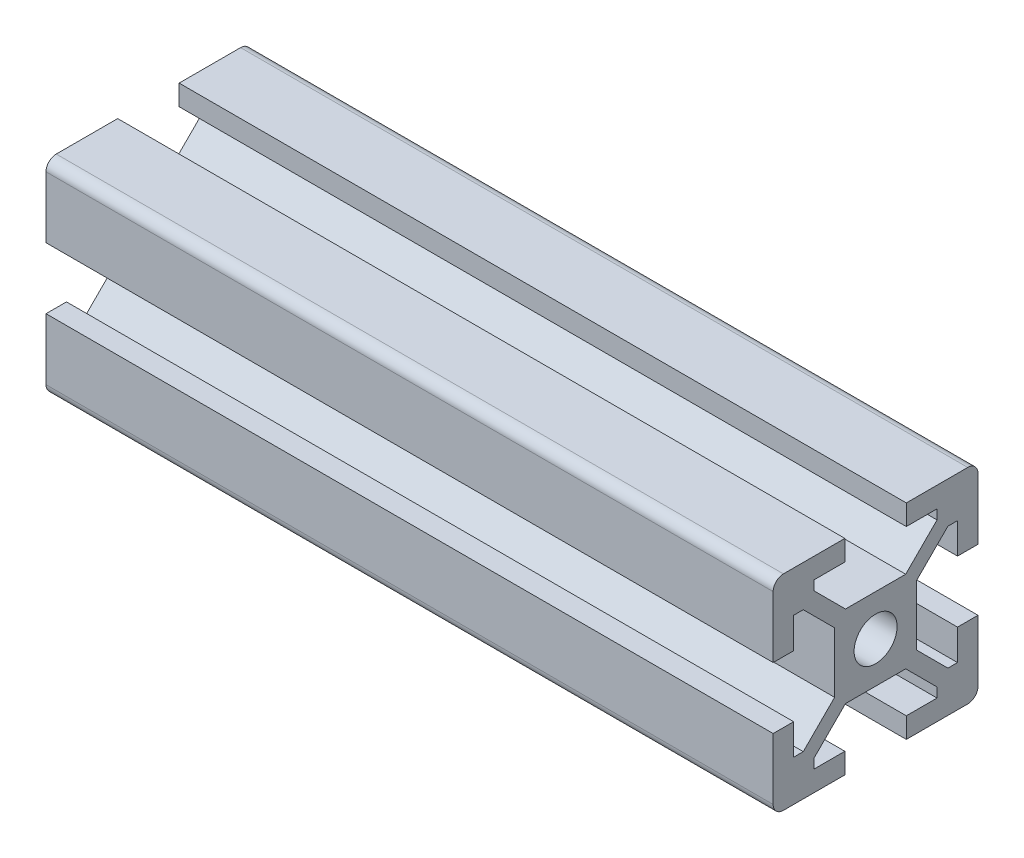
ISO-10303-21;
HEADER;
FILE_DESCRIPTION(('STEP AP214'),'2;1');
FILE_NAME('part.step','',(''),(''),'','','');
FILE_SCHEMA(('AUTOMOTIVE_DESIGN { 1 0 10303 214 1 1 1 1 }'));
ENDSEC;
DATA;
#1=APPLICATION_CONTEXT('core data for automotive mechanical design processes');
#2=APPLICATION_PROTOCOL_DEFINITION('international standard','automotive_design',2000,#1);
#3=PRODUCT_CONTEXT('',#1,'mechanical');
#4=PRODUCT('Part','Part','',(#3));
#5=PRODUCT_RELATED_PRODUCT_CATEGORY('part','',(#4));
#6=PRODUCT_DEFINITION_FORMATION('','',#4);
#7=PRODUCT_DEFINITION_CONTEXT('part definition',#1,'design');
#8=PRODUCT_DEFINITION('design','',#6,#7);
#9=PRODUCT_DEFINITION_SHAPE('','',#8);
#10=(LENGTH_UNIT() NAMED_UNIT(*) SI_UNIT(.MILLI.,.METRE.));
#11=(NAMED_UNIT(*) PLANE_ANGLE_UNIT() SI_UNIT($,.RADIAN.));
#12=(NAMED_UNIT(*) SI_UNIT($,.STERADIAN.) SOLID_ANGLE_UNIT());
#13=UNCERTAINTY_MEASURE_WITH_UNIT(LENGTH_MEASURE(1.E-05),#10,'distance_accuracy_value','');
#14=(GEOMETRIC_REPRESENTATION_CONTEXT(3) GLOBAL_UNCERTAINTY_ASSIGNED_CONTEXT((#13)) GLOBAL_UNIT_ASSIGNED_CONTEXT((#10,
#11,#12)) REPRESENTATION_CONTEXT('',''));
#15=CARTESIAN_POINT('',(0.,0.,0.));
#16=DIRECTION('',(0.,0.,1.));
#17=DIRECTION('',(1.,0.,0.));
#18=AXIS2_PLACEMENT_3D('',#15,#16,#17);
#19=CARTESIAN_POINT('',(71.,9.,9.));
#20=DIRECTION('',(1.,0.,0.));
#21=DIRECTION('',(0.,0.,-1.));
#22=AXIS2_PLACEMENT_3D('',#19,#20,#21);
#23=PLANE('',#22);
#24=CARTESIAN_POINT('',(71.,9.,9.));
#25=DIRECTION('',(1.,0.,0.));
#26=DIRECTION('',(0.,0.,-1.));
#27=AXIS2_PLACEMENT_3D('',#24,#25,#26);
#28=CIRCLE('',#27,1.);
#29=CARTESIAN_POINT('',(71.,10.,9.));
#30=VERTEX_POINT('',#29);
#31=CARTESIAN_POINT('',(71.,9.,10.));
#32=VERTEX_POINT('',#31);
#33=EDGE_CURVE('E471',#30,#32,#28,.T.);
#34=ORIENTED_EDGE('',*,*,#33,.T.);
#35=DIRECTION('',(0.,-1.,0.));
#36=VECTOR('',#35,1.);
#37=CARTESIAN_POINT('',(71.,9.,10.));
#38=LINE('',#37,#36);
#39=CARTESIAN_POINT('',(71.,3.,10.));
#40=VERTEX_POINT('',#39);
#41=EDGE_CURVE('E221',#32,#40,#38,.T.);
#42=ORIENTED_EDGE('',*,*,#41,.T.);
#43=DIRECTION('',(0.,0.,-1.));
#44=VECTOR('',#43,1.);
#45=CARTESIAN_POINT('',(71.,3.,10.));
#46=LINE('',#45,#44);
#47=CARTESIAN_POINT('',(71.,3.,8.));
#48=VERTEX_POINT('',#47);
#49=EDGE_CURVE('E606',#40,#48,#46,.T.);
#50=ORIENTED_EDGE('',*,*,#49,.T.);
#51=DIRECTION('',(0.,1.,0.));
#52=VECTOR('',#51,1.);
#53=CARTESIAN_POINT('',(71.,3.,8.));
#54=LINE('',#53,#52);
#55=CARTESIAN_POINT('',(71.,6.,8.));
#56=VERTEX_POINT('',#55);
#57=EDGE_CURVE('E630',#48,#56,#54,.T.);
#58=ORIENTED_EDGE('',*,*,#57,.T.);
#59=DIRECTION('',(0.,0.,-1.));
#60=VECTOR('',#59,1.);
#61=CARTESIAN_POINT('',(71.,6.,8.));
#62=LINE('',#61,#60);
#63=CARTESIAN_POINT('',(71.,6.,7.06066017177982));
#64=VERTEX_POINT('',#63);
#65=EDGE_CURVE('E624',#56,#64,#62,.T.);
#66=ORIENTED_EDGE('',*,*,#65,.T.);
#67=DIRECTION('',(0.,-0.707106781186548,-0.707106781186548));
#68=VECTOR('',#67,1.);
#69=CARTESIAN_POINT('',(71.,6.,7.06066017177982));
#70=LINE('',#69,#68);
#71=CARTESIAN_POINT('',(71.,2.93933982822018,4.));
#72=VERTEX_POINT('',#71);
#73=EDGE_CURVE('E626',#64,#72,#70,.T.);
#74=ORIENTED_EDGE('',*,*,#73,.T.);
#75=DIRECTION('',(0.,-1.,0.));
#76=VECTOR('',#75,1.);
#77=CARTESIAN_POINT('',(71.,2.93933982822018,4.));
#78=LINE('',#77,#76);
#79=CARTESIAN_POINT('',(71.,-2.93933982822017,4.));
#80=VERTEX_POINT('',#79);
#81=EDGE_CURVE('E627',#72,#80,#78,.T.);
#82=ORIENTED_EDGE('',*,*,#81,.T.);
#83=DIRECTION('',(0.,-0.707106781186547,0.707106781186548));
#84=VECTOR('',#83,1.);
#85=CARTESIAN_POINT('',(71.,-2.93933982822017,4.));
#86=LINE('',#85,#84);
#87=CARTESIAN_POINT('',(71.,-6.,7.06066017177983));
#88=VERTEX_POINT('',#87);
#89=EDGE_CURVE('E634',#80,#88,#86,.T.);
#90=ORIENTED_EDGE('',*,*,#89,.T.);
#91=DIRECTION('',(0.,0.,1.));
#92=VECTOR('',#91,1.);
#93=CARTESIAN_POINT('',(71.,-6.,7.06066017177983));
#94=LINE('',#93,#92);
#95=CARTESIAN_POINT('',(71.,-6.,7.99999999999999));
#96=VERTEX_POINT('',#95);
#97=EDGE_CURVE('E640',#88,#96,#94,.T.);
#98=ORIENTED_EDGE('',*,*,#97,.T.);
#99=DIRECTION('',(0.,1.,0.));
#100=VECTOR('',#99,1.);
#101=CARTESIAN_POINT('',(71.,-6.,7.99999999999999));
#102=LINE('',#101,#100);
#103=CARTESIAN_POINT('',(71.,-3.,7.99999999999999));
#104=VERTEX_POINT('',#103);
#105=EDGE_CURVE('E638',#96,#104,#102,.T.);
#106=ORIENTED_EDGE('',*,*,#105,.T.);
#107=DIRECTION('',(0.,0.,1.));
#108=VECTOR('',#107,1.);
#109=CARTESIAN_POINT('',(71.,-3.,7.99999999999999));
#110=LINE('',#109,#108);
#111=CARTESIAN_POINT('',(71.,-3.,10.));
#112=VERTEX_POINT('',#111);
#113=EDGE_CURVE('E642',#104,#112,#110,.T.);
#114=ORIENTED_EDGE('',*,*,#113,.T.);
#115=DIRECTION('',(0.,-1.,0.));
#116=VECTOR('',#115,1.);
#117=CARTESIAN_POINT('',(71.,-3.,10.));
#118=LINE('',#117,#116);
#119=CARTESIAN_POINT('',(71.,-9.,10.));
#120=VERTEX_POINT('',#119);
#121=EDGE_CURVE('E644',#112,#120,#118,.T.);
#122=ORIENTED_EDGE('',*,*,#121,.T.);
#123=CARTESIAN_POINT('',(71.,-9.,9.));
#124=DIRECTION('',(1.,0.,0.));
#125=DIRECTION('',(0.,0.,-1.));
#126=AXIS2_PLACEMENT_3D('',#123,#124,#125);
#127=CIRCLE('',#126,1.);
#128=CARTESIAN_POINT('',(71.,-10.,9.));
#129=VERTEX_POINT('',#128);
#130=EDGE_CURVE('E643',#120,#129,#127,.T.);
#131=ORIENTED_EDGE('',*,*,#130,.T.);
#132=DIRECTION('',(0.,0.,-1.));
#133=VECTOR('',#132,1.);
#134=CARTESIAN_POINT('',(71.,-10.,9.));
#135=LINE('',#134,#133);
#136=CARTESIAN_POINT('',(71.,-10.,3.));
#137=VERTEX_POINT('',#136);
#138=EDGE_CURVE('E650',#129,#137,#135,.T.);
#139=ORIENTED_EDGE('',*,*,#138,.T.);
#140=DIRECTION('',(0.,1.,0.));
#141=VECTOR('',#140,1.);
#142=CARTESIAN_POINT('',(71.,-10.,3.));
#143=LINE('',#142,#141);
#144=CARTESIAN_POINT('',(71.,-8.,3.));
#145=VERTEX_POINT('',#144);
#146=EDGE_CURVE('E649',#137,#145,#143,.T.);
#147=ORIENTED_EDGE('',*,*,#146,.T.);
#148=DIRECTION('',(0.,0.,1.));
#149=VECTOR('',#148,1.);
#150=CARTESIAN_POINT('',(71.,-8.,3.));
#151=LINE('',#150,#149);
#152=CARTESIAN_POINT('',(71.,-8.,6.));
#153=VERTEX_POINT('',#152);
#154=EDGE_CURVE('E652',#145,#153,#151,.T.);
#155=ORIENTED_EDGE('',*,*,#154,.T.);
#156=DIRECTION('',(0.,1.,0.));
#157=VECTOR('',#156,1.);
#158=CARTESIAN_POINT('',(71.,-8.,6.));
#159=LINE('',#158,#157);
#160=CARTESIAN_POINT('',(71.,-7.06066017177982,6.));
#161=VERTEX_POINT('',#160);
#162=EDGE_CURVE('E651',#153,#161,#159,.T.);
#163=ORIENTED_EDGE('',*,*,#162,.T.);
#164=DIRECTION('',(0.,0.707106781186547,-0.707106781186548));
#165=VECTOR('',#164,1.);
#166=CARTESIAN_POINT('',(71.,-7.06066017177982,6.));
#167=LINE('',#166,#165);
#168=CARTESIAN_POINT('',(71.,-4.,2.93933982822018));
#169=VERTEX_POINT('',#168);
#170=EDGE_CURVE('E653',#161,#169,#167,.T.);
#171=ORIENTED_EDGE('',*,*,#170,.T.);
#172=DIRECTION('',(0.,0.,-1.));
#173=VECTOR('',#172,1.);
#174=CARTESIAN_POINT('',(71.,-4.,2.93933982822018));
#175=LINE('',#174,#173);
#176=CARTESIAN_POINT('',(71.,-4.,-2.93933982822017));
#177=VERTEX_POINT('',#176);
#178=EDGE_CURVE('E660',#169,#177,#175,.T.);
#179=ORIENTED_EDGE('',*,*,#178,.T.);
#180=DIRECTION('',(0.,-0.707106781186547,-0.707106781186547));
#181=VECTOR('',#180,1.);
#182=CARTESIAN_POINT('',(71.,-4.,-2.93933982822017));
#183=LINE('',#182,#181);
#184=CARTESIAN_POINT('',(71.,-7.06066017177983,-6.));
#185=VERTEX_POINT('',#184);
#186=EDGE_CURVE('E659',#177,#185,#183,.T.);
#187=ORIENTED_EDGE('',*,*,#186,.T.);
#188=DIRECTION('',(0.,-1.,0.));
#189=VECTOR('',#188,1.);
#190=CARTESIAN_POINT('',(71.,-7.06066017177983,-6.));
#191=LINE('',#190,#189);
#192=CARTESIAN_POINT('',(71.,-7.99999999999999,-6.));
#193=VERTEX_POINT('',#192);
#194=EDGE_CURVE('E663',#185,#193,#191,.T.);
#195=ORIENTED_EDGE('',*,*,#194,.T.);
#196=DIRECTION('',(0.,0.,1.));
#197=VECTOR('',#196,1.);
#198=CARTESIAN_POINT('',(71.,-7.99999999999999,-6.));
#199=LINE('',#198,#197);
#200=CARTESIAN_POINT('',(71.,-7.99999999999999,-3.));
#201=VERTEX_POINT('',#200);
#202=EDGE_CURVE('E661',#193,#201,#199,.T.);
#203=ORIENTED_EDGE('',*,*,#202,.T.);
#204=DIRECTION('',(0.,-1.,0.));
#205=VECTOR('',#204,1.);
#206=CARTESIAN_POINT('',(71.,-7.99999999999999,-3.));
#207=LINE('',#206,#205);
#208=CARTESIAN_POINT('',(71.,-10.,-3.));
#209=VERTEX_POINT('',#208);
#210=EDGE_CURVE('E664',#201,#209,#207,.T.);
#211=ORIENTED_EDGE('',*,*,#210,.T.);
#212=DIRECTION('',(0.,0.,-1.));
#213=VECTOR('',#212,1.);
#214=CARTESIAN_POINT('',(71.,-10.,-3.));
#215=LINE('',#214,#213);
#216=CARTESIAN_POINT('',(71.,-10.,-9.00000000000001));
#217=VERTEX_POINT('',#216);
#218=EDGE_CURVE('E670',#209,#217,#215,.T.);
#219=ORIENTED_EDGE('',*,*,#218,.T.);
#220=CARTESIAN_POINT('',(71.,-9.,-9.00000000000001));
#221=DIRECTION('',(1.,0.,0.));
#222=DIRECTION('',(0.,0.,-1.));
#223=AXIS2_PLACEMENT_3D('',#220,#221,#222);
#224=CIRCLE('',#223,0.999999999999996);
#225=CARTESIAN_POINT('',(71.,-9.,-10.));
#226=VERTEX_POINT('',#225);
#227=EDGE_CURVE('E669',#217,#226,#224,.T.);
#228=ORIENTED_EDGE('',*,*,#227,.T.);
#229=DIRECTION('',(0.,1.,0.));
#230=VECTOR('',#229,1.);
#231=CARTESIAN_POINT('',(71.,-9.,-10.));
#232=LINE('',#231,#230);
#233=CARTESIAN_POINT('',(71.,-3.,-10.));
#234=VERTEX_POINT('',#233);
#235=EDGE_CURVE('E671',#226,#234,#232,.T.);
#236=ORIENTED_EDGE('',*,*,#235,.T.);
#237=DIRECTION('',(0.,0.,1.));
#238=VECTOR('',#237,1.);
#239=CARTESIAN_POINT('',(71.,-3.,-10.));
#240=LINE('',#239,#238);
#241=CARTESIAN_POINT('',(71.,-3.,-8.00000000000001));
#242=VERTEX_POINT('',#241);
#243=EDGE_CURVE('E673',#234,#242,#240,.T.);
#244=ORIENTED_EDGE('',*,*,#243,.T.);
#245=DIRECTION('',(0.,-1.,0.));
#246=VECTOR('',#245,1.);
#247=CARTESIAN_POINT('',(71.,-3.,-8.00000000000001));
#248=LINE('',#247,#246);
#249=CARTESIAN_POINT('',(71.,-6.,-8.00000000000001));
#250=VERTEX_POINT('',#249);
#251=EDGE_CURVE('E674',#242,#250,#248,.T.);
#252=ORIENTED_EDGE('',*,*,#251,.T.);
#253=DIRECTION('',(0.,0.,1.));
#254=VECTOR('',#253,1.);
#255=CARTESIAN_POINT('',(71.,-6.,-8.00000000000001));
#256=LINE('',#255,#254);
#257=CARTESIAN_POINT('',(71.,-6.,-7.06066017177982));
#258=VERTEX_POINT('',#257);
#259=EDGE_CURVE('E680',#250,#258,#256,.T.);
#260=ORIENTED_EDGE('',*,*,#259,.T.);
#261=DIRECTION('',(0.,0.707106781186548,0.707106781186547));
#262=VECTOR('',#261,1.);
#263=CARTESIAN_POINT('',(71.,-6.,-7.06066017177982));
#264=LINE('',#263,#262);
#265=CARTESIAN_POINT('',(71.,-2.93933982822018,-4.));
#266=VERTEX_POINT('',#265);
#267=EDGE_CURVE('E677',#258,#266,#264,.T.);
#268=ORIENTED_EDGE('',*,*,#267,.T.);
#269=DIRECTION('',(0.,1.,0.));
#270=VECTOR('',#269,1.);
#271=CARTESIAN_POINT('',(71.,-2.93933982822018,-4.));
#272=LINE('',#271,#270);
#273=CARTESIAN_POINT('',(71.,2.93933982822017,-4.));
#274=VERTEX_POINT('',#273);
#275=EDGE_CURVE('E681',#266,#274,#272,.T.);
#276=ORIENTED_EDGE('',*,*,#275,.T.);
#277=DIRECTION('',(0.,0.707106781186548,-0.707106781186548));
#278=VECTOR('',#277,1.);
#279=CARTESIAN_POINT('',(71.,2.93933982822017,-4.));
#280=LINE('',#279,#278);
#281=CARTESIAN_POINT('',(71.,6.,-7.06066017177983));
#282=VERTEX_POINT('',#281);
#283=EDGE_CURVE('E682',#274,#282,#280,.T.);
#284=ORIENTED_EDGE('',*,*,#283,.T.);
#285=DIRECTION('',(0.,0.,-1.));
#286=VECTOR('',#285,1.);
#287=CARTESIAN_POINT('',(71.,6.,-7.06066017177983));
#288=LINE('',#287,#286);
#289=CARTESIAN_POINT('',(71.,6.,-7.99999999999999));
#290=VERTEX_POINT('',#289);
#291=EDGE_CURVE('E684',#282,#290,#288,.T.);
#292=ORIENTED_EDGE('',*,*,#291,.T.);
#293=DIRECTION('',(0.,-1.,0.));
#294=VECTOR('',#293,1.);
#295=CARTESIAN_POINT('',(71.,6.,-7.99999999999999));
#296=LINE('',#295,#294);
#297=CARTESIAN_POINT('',(71.,3.,-7.99999999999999));
#298=VERTEX_POINT('',#297);
#299=EDGE_CURVE('E690',#290,#298,#296,.T.);
#300=ORIENTED_EDGE('',*,*,#299,.T.);
#301=DIRECTION('',(0.,0.,-1.));
#302=VECTOR('',#301,1.);
#303=CARTESIAN_POINT('',(71.,3.,-7.99999999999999));
#304=LINE('',#303,#302);
#305=CARTESIAN_POINT('',(71.,3.,-10.));
#306=VERTEX_POINT('',#305);
#307=EDGE_CURVE('E686',#298,#306,#304,.T.);
#308=ORIENTED_EDGE('',*,*,#307,.T.);
#309=DIRECTION('',(0.,1.,0.));
#310=VECTOR('',#309,1.);
#311=CARTESIAN_POINT('',(71.,3.,-10.));
#312=LINE('',#311,#310);
#313=CARTESIAN_POINT('',(71.,9.,-10.));
#314=VERTEX_POINT('',#313);
#315=EDGE_CURVE('E693',#306,#314,#312,.T.);
#316=ORIENTED_EDGE('',*,*,#315,.T.);
#317=CARTESIAN_POINT('',(71.,9.,-9.00000000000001));
#318=DIRECTION('',(1.,0.,0.));
#319=DIRECTION('',(0.,0.,-1.));
#320=AXIS2_PLACEMENT_3D('',#317,#318,#319);
#321=CIRCLE('',#320,1.);
#322=CARTESIAN_POINT('',(71.,10.,-9.00000000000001));
#323=VERTEX_POINT('',#322);
#324=EDGE_CURVE('E691',#314,#323,#321,.T.);
#325=ORIENTED_EDGE('',*,*,#324,.T.);
#326=DIRECTION('',(0.,0.,1.));
#327=VECTOR('',#326,1.);
#328=CARTESIAN_POINT('',(71.,10.,-9.00000000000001));
#329=LINE('',#328,#327);
#330=CARTESIAN_POINT('',(71.,10.,-3.));
#331=VERTEX_POINT('',#330);
#332=EDGE_CURVE('E692',#323,#331,#329,.T.);
#333=ORIENTED_EDGE('',*,*,#332,.T.);
#334=DIRECTION('',(0.,-1.,0.));
#335=VECTOR('',#334,1.);
#336=CARTESIAN_POINT('',(71.,10.,-3.));
#337=LINE('',#336,#335);
#338=CARTESIAN_POINT('',(71.,8.,-3.));
#339=VERTEX_POINT('',#338);
#340=EDGE_CURVE('E700',#331,#339,#337,.T.);
#341=ORIENTED_EDGE('',*,*,#340,.T.);
#342=DIRECTION('',(0.,0.,-1.));
#343=VECTOR('',#342,1.);
#344=CARTESIAN_POINT('',(71.,8.,-3.));
#345=LINE('',#344,#343);
#346=CARTESIAN_POINT('',(71.,8.,-6.));
#347=VERTEX_POINT('',#346);
#348=EDGE_CURVE('E699',#339,#347,#345,.T.);
#349=ORIENTED_EDGE('',*,*,#348,.T.);
#350=DIRECTION('',(0.,-1.,0.));
#351=VECTOR('',#350,1.);
#352=CARTESIAN_POINT('',(71.,8.,-6.));
#353=LINE('',#352,#351);
#354=CARTESIAN_POINT('',(71.,7.06066017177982,-6.));
#355=VERTEX_POINT('',#354);
#356=EDGE_CURVE('E703',#347,#355,#353,.T.);
#357=ORIENTED_EDGE('',*,*,#356,.T.);
#358=DIRECTION('',(0.,-0.707106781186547,0.707106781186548));
#359=VECTOR('',#358,1.);
#360=CARTESIAN_POINT('',(71.,7.06066017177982,-6.));
#361=LINE('',#360,#359);
#362=CARTESIAN_POINT('',(71.,4.,-2.93933982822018));
#363=VERTEX_POINT('',#362);
#364=EDGE_CURVE('E701',#355,#363,#361,.T.);
#365=ORIENTED_EDGE('',*,*,#364,.T.);
#366=DIRECTION('',(0.,0.,1.));
#367=VECTOR('',#366,1.);
#368=CARTESIAN_POINT('',(71.,4.,-2.93933982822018));
#369=LINE('',#368,#367);
#370=CARTESIAN_POINT('',(71.,4.,2.93933982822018));
#371=VERTEX_POINT('',#370);
#372=EDGE_CURVE('E702',#363,#371,#369,.T.);
#373=ORIENTED_EDGE('',*,*,#372,.T.);
#374=DIRECTION('',(0.,0.707106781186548,0.707106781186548));
#375=VECTOR('',#374,1.);
#376=CARTESIAN_POINT('',(71.,4.,2.93933982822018));
#377=LINE('',#376,#375);
#378=CARTESIAN_POINT('',(71.,7.06066017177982,6.));
#379=VERTEX_POINT('',#378);
#380=EDGE_CURVE('E707',#371,#379,#377,.T.);
#381=ORIENTED_EDGE('',*,*,#380,.T.);
#382=DIRECTION('',(0.,1.,0.));
#383=VECTOR('',#382,1.);
#384=CARTESIAN_POINT('',(71.,7.06066017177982,6.));
#385=LINE('',#384,#383);
#386=CARTESIAN_POINT('',(71.,7.99999999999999,6.));
#387=VERTEX_POINT('',#386);
#388=EDGE_CURVE('E359',#379,#387,#385,.T.);
#389=ORIENTED_EDGE('',*,*,#388,.T.);
#390=DIRECTION('',(0.,0.,-1.));
#391=VECTOR('',#390,1.);
#392=CARTESIAN_POINT('',(71.,7.99999999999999,6.));
#393=LINE('',#392,#391);
#394=CARTESIAN_POINT('',(71.,7.99999999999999,3.));
#395=VERTEX_POINT('',#394);
#396=EDGE_CURVE('E354',#387,#395,#393,.T.);
#397=ORIENTED_EDGE('',*,*,#396,.T.);
#398=DIRECTION('',(0.,1.,0.));
#399=VECTOR('',#398,1.);
#400=CARTESIAN_POINT('',(71.,7.99999999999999,3.));
#401=LINE('',#400,#399);
#402=CARTESIAN_POINT('',(71.,10.,3.));
#403=VERTEX_POINT('',#402);
#404=EDGE_CURVE('E358',#395,#403,#401,.T.);
#405=ORIENTED_EDGE('',*,*,#404,.T.);
#406=DIRECTION('',(0.,0.,1.));
#407=VECTOR('',#406,1.);
#408=CARTESIAN_POINT('',(71.,10.,3.));
#409=LINE('',#408,#407);
#410=EDGE_CURVE('E59',#403,#30,#409,.T.);
#411=ORIENTED_EDGE('',*,*,#410,.T.);
#412=EDGE_LOOP('',(#34,#42,#50,#58,#66,#74,#82,#90,#98,#106,#114,#122,#131,#139,#147,#155,#163,
#171,#179,#187,#195,#203,#211,#219,#228,#236,#244,#252,#260,#268,#276,#284,#292,#300,#308,#316,
#325,#333,#341,#349,#357,#365,#373,#381,#389,#397,#405,#411));
#413=FACE_BOUND('',#412,.T.);
#414=CARTESIAN_POINT('',(71.,0.,0.));
#415=DIRECTION('',(1.,0.,0.));
#416=DIRECTION('',(0.,0.,-1.));
#417=AXIS2_PLACEMENT_3D('',#414,#415,#416);
#418=CIRCLE('',#417,2.1);
#419=CARTESIAN_POINT('',(71.,0.,-2.1));
#420=VERTEX_POINT('',#419);
#421=EDGE_CURVE('E385',#420,#420,#418,.T.);
#422=ORIENTED_EDGE('',*,*,#421,.F.);
#423=EDGE_LOOP('',(#422));
#424=FACE_BOUND('',#423,.T.);
#425=ADVANCED_FACE('F41',(#413,#424),#23,.T.);
#426=CARTESIAN_POINT('',(0.,9.,9.));
#427=DIRECTION('',(1.,0.,0.));
#428=DIRECTION('',(0.,0.,-1.));
#429=AXIS2_PLACEMENT_3D('',#426,#427,#428);
#430=PLANE('',#429);
#431=CARTESIAN_POINT('',(0.,9.,9.));
#432=DIRECTION('',(1.,0.,0.));
#433=DIRECTION('',(0.,0.,-1.));
#434=AXIS2_PLACEMENT_3D('',#431,#432,#433);
#435=CIRCLE('',#434,1.);
#436=CARTESIAN_POINT('',(0.,10.,9.));
#437=VERTEX_POINT('',#436);
#438=CARTESIAN_POINT('',(0.,9.,10.));
#439=VERTEX_POINT('',#438);
#440=EDGE_CURVE('E376',#437,#439,#435,.T.);
#441=ORIENTED_EDGE('',*,*,#440,.F.);
#442=DIRECTION('',(0.,0.,1.));
#443=VECTOR('',#442,1.);
#444=CARTESIAN_POINT('',(0.,10.,3.));
#445=LINE('',#444,#443);
#446=CARTESIAN_POINT('',(0.,10.,3.));
#447=VERTEX_POINT('',#446);
#448=EDGE_CURVE('E211',#447,#437,#445,.T.);
#449=ORIENTED_EDGE('',*,*,#448,.F.);
#450=DIRECTION('',(0.,1.,0.));
#451=VECTOR('',#450,1.);
#452=CARTESIAN_POINT('',(0.,7.99999999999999,3.));
#453=LINE('',#452,#451);
#454=CARTESIAN_POINT('',(0.,7.99999999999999,3.));
#455=VERTEX_POINT('',#454);
#456=EDGE_CURVE('E210',#455,#447,#453,.T.);
#457=ORIENTED_EDGE('',*,*,#456,.F.);
#458=DIRECTION('',(0.,0.,-1.));
#459=VECTOR('',#458,1.);
#460=CARTESIAN_POINT('',(0.,7.99999999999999,6.));
#461=LINE('',#460,#459);
#462=CARTESIAN_POINT('',(0.,7.99999999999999,6.));
#463=VERTEX_POINT('',#462);
#464=EDGE_CURVE('E367',#463,#455,#461,.T.);
#465=ORIENTED_EDGE('',*,*,#464,.F.);
#466=DIRECTION('',(0.,1.,0.));
#467=VECTOR('',#466,1.);
#468=CARTESIAN_POINT('',(0.,7.06066017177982,6.));
#469=LINE('',#468,#467);
#470=CARTESIAN_POINT('',(0.,7.06066017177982,6.));
#471=VERTEX_POINT('',#470);
#472=EDGE_CURVE('E466',#471,#463,#469,.T.);
#473=ORIENTED_EDGE('',*,*,#472,.F.);
#474=DIRECTION('',(0.,0.707106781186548,0.707106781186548));
#475=VECTOR('',#474,1.);
#476=CARTESIAN_POINT('',(0.,4.,2.93933982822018));
#477=LINE('',#476,#475);
#478=CARTESIAN_POINT('',(0.,4.,2.93933982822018));
#479=VERTEX_POINT('',#478);
#480=EDGE_CURVE('E468',#479,#471,#477,.T.);
#481=ORIENTED_EDGE('',*,*,#480,.F.);
#482=DIRECTION('',(0.,0.,1.));
#483=VECTOR('',#482,1.);
#484=CARTESIAN_POINT('',(0.,4.,-2.93933982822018));
#485=LINE('',#484,#483);
#486=CARTESIAN_POINT('',(0.,4.,-2.93933982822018));
#487=VERTEX_POINT('',#486);
#488=EDGE_CURVE('E461',#487,#479,#485,.T.);
#489=ORIENTED_EDGE('',*,*,#488,.F.);
#490=DIRECTION('',(0.,-0.707106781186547,0.707106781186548));
#491=VECTOR('',#490,1.);
#492=CARTESIAN_POINT('',(0.,7.06066017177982,-6.));
#493=LINE('',#492,#491);
#494=CARTESIAN_POINT('',(0.,7.06066017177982,-6.));
#495=VERTEX_POINT('',#494);
#496=EDGE_CURVE('E465',#495,#487,#493,.T.);
#497=ORIENTED_EDGE('',*,*,#496,.F.);
#498=DIRECTION('',(0.,-1.,0.));
#499=VECTOR('',#498,1.);
#500=CARTESIAN_POINT('',(0.,8.,-6.));
#501=LINE('',#500,#499);
#502=CARTESIAN_POINT('',(0.,8.,-6.));
#503=VERTEX_POINT('',#502);
#504=EDGE_CURVE('E459',#503,#495,#501,.T.);
#505=ORIENTED_EDGE('',*,*,#504,.F.);
#506=DIRECTION('',(0.,0.,-1.));
#507=VECTOR('',#506,1.);
#508=CARTESIAN_POINT('',(0.,8.,-3.));
#509=LINE('',#508,#507);
#510=CARTESIAN_POINT('',(0.,8.,-3.));
#511=VERTEX_POINT('',#510);
#512=EDGE_CURVE('E457',#511,#503,#509,.T.);
#513=ORIENTED_EDGE('',*,*,#512,.F.);
#514=DIRECTION('',(0.,-1.,0.));
#515=VECTOR('',#514,1.);
#516=CARTESIAN_POINT('',(0.,10.,-3.));
#517=LINE('',#516,#515);
#518=CARTESIAN_POINT('',(0.,10.,-3.));
#519=VERTEX_POINT('',#518);
#520=EDGE_CURVE('E456',#519,#511,#517,.T.);
#521=ORIENTED_EDGE('',*,*,#520,.F.);
#522=DIRECTION('',(0.,0.,1.));
#523=VECTOR('',#522,1.);
#524=CARTESIAN_POINT('',(0.,10.,-9.00000000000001));
#525=LINE('',#524,#523);
#526=CARTESIAN_POINT('',(0.,10.,-9.00000000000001));
#527=VERTEX_POINT('',#526);
#528=EDGE_CURVE('E452',#527,#519,#525,.T.);
#529=ORIENTED_EDGE('',*,*,#528,.F.);
#530=CARTESIAN_POINT('',(0.,9.,-9.00000000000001));
#531=DIRECTION('',(1.,0.,0.));
#532=DIRECTION('',(0.,0.,-1.));
#533=AXIS2_PLACEMENT_3D('',#530,#531,#532);
#534=CIRCLE('',#533,1.);
#535=CARTESIAN_POINT('',(0.,9.,-10.));
#536=VERTEX_POINT('',#535);
#537=EDGE_CURVE('E455',#536,#527,#534,.T.);
#538=ORIENTED_EDGE('',*,*,#537,.F.);
#539=DIRECTION('',(0.,1.,0.));
#540=VECTOR('',#539,1.);
#541=CARTESIAN_POINT('',(0.,3.,-10.));
#542=LINE('',#541,#540);
#543=CARTESIAN_POINT('',(0.,3.,-10.));
#544=VERTEX_POINT('',#543);
#545=EDGE_CURVE('E449',#544,#536,#542,.T.);
#546=ORIENTED_EDGE('',*,*,#545,.F.);
#547=DIRECTION('',(0.,0.,-1.));
#548=VECTOR('',#547,1.);
#549=CARTESIAN_POINT('',(0.,3.,-7.99999999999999));
#550=LINE('',#549,#548);
#551=CARTESIAN_POINT('',(0.,3.,-7.99999999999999));
#552=VERTEX_POINT('',#551);
#553=EDGE_CURVE('E448',#552,#544,#550,.T.);
#554=ORIENTED_EDGE('',*,*,#553,.F.);
#555=DIRECTION('',(0.,-1.,0.));
#556=VECTOR('',#555,1.);
#557=CARTESIAN_POINT('',(0.,6.,-7.99999999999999));
#558=LINE('',#557,#556);
#559=CARTESIAN_POINT('',(0.,6.,-7.99999999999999));
#560=VERTEX_POINT('',#559);
#561=EDGE_CURVE('E446',#560,#552,#558,.T.);
#562=ORIENTED_EDGE('',*,*,#561,.F.);
#563=DIRECTION('',(0.,0.,-1.));
#564=VECTOR('',#563,1.);
#565=CARTESIAN_POINT('',(0.,6.,-7.06066017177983));
#566=LINE('',#565,#564);
#567=CARTESIAN_POINT('',(0.,6.,-7.06066017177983));
#568=VERTEX_POINT('',#567);
#569=EDGE_CURVE('E444',#568,#560,#566,.T.);
#570=ORIENTED_EDGE('',*,*,#569,.F.);
#571=DIRECTION('',(0.,0.707106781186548,-0.707106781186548));
#572=VECTOR('',#571,1.);
#573=CARTESIAN_POINT('',(0.,2.93933982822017,-4.));
#574=LINE('',#573,#572);
#575=CARTESIAN_POINT('',(0.,2.93933982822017,-4.));
#576=VERTEX_POINT('',#575);
#577=EDGE_CURVE('E445',#576,#568,#574,.T.);
#578=ORIENTED_EDGE('',*,*,#577,.F.);
#579=DIRECTION('',(0.,1.,0.));
#580=VECTOR('',#579,1.);
#581=CARTESIAN_POINT('',(0.,-2.93933982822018,-4.));
#582=LINE('',#581,#580);
#583=CARTESIAN_POINT('',(0.,-2.93933982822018,-4.));
#584=VERTEX_POINT('',#583);
#585=EDGE_CURVE('E439',#584,#576,#582,.T.);
#586=ORIENTED_EDGE('',*,*,#585,.F.);
#587=DIRECTION('',(0.,0.707106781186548,0.707106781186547));
#588=VECTOR('',#587,1.);
#589=CARTESIAN_POINT('',(0.,-6.,-7.06066017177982));
#590=LINE('',#589,#588);
#591=CARTESIAN_POINT('',(0.,-6.,-7.06066017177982));
#592=VERTEX_POINT('',#591);
#593=EDGE_CURVE('E436',#592,#584,#590,.T.);
#594=ORIENTED_EDGE('',*,*,#593,.F.);
#595=DIRECTION('',(0.,0.,1.));
#596=VECTOR('',#595,1.);
#597=CARTESIAN_POINT('',(0.,-6.,-8.00000000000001));
#598=LINE('',#597,#596);
#599=CARTESIAN_POINT('',(0.,-6.,-8.00000000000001));
#600=VERTEX_POINT('',#599);
#601=EDGE_CURVE('E438',#600,#592,#598,.T.);
#602=ORIENTED_EDGE('',*,*,#601,.F.);
#603=DIRECTION('',(0.,-1.,0.));
#604=VECTOR('',#603,1.);
#605=CARTESIAN_POINT('',(0.,-3.,-8.00000000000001));
#606=LINE('',#605,#604);
#607=CARTESIAN_POINT('',(0.,-3.,-8.00000000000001));
#608=VERTEX_POINT('',#607);
#609=EDGE_CURVE('E434',#608,#600,#606,.T.);
#610=ORIENTED_EDGE('',*,*,#609,.F.);
#611=DIRECTION('',(0.,0.,1.));
#612=VECTOR('',#611,1.);
#613=CARTESIAN_POINT('',(0.,-3.,-10.));
#614=LINE('',#613,#612);
#615=CARTESIAN_POINT('',(0.,-3.,-10.));
#616=VERTEX_POINT('',#615);
#617=EDGE_CURVE('E435',#616,#608,#614,.T.);
#618=ORIENTED_EDGE('',*,*,#617,.F.);
#619=DIRECTION('',(0.,1.,0.));
#620=VECTOR('',#619,1.);
#621=CARTESIAN_POINT('',(0.,-9.,-10.));
#622=LINE('',#621,#620);
#623=CARTESIAN_POINT('',(0.,-9.,-10.));
#624=VERTEX_POINT('',#623);
#625=EDGE_CURVE('E428',#624,#616,#622,.T.);
#626=ORIENTED_EDGE('',*,*,#625,.F.);
#627=CARTESIAN_POINT('',(0.,-9.,-9.00000000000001));
#628=DIRECTION('',(1.,0.,0.));
#629=DIRECTION('',(0.,0.,-1.));
#630=AXIS2_PLACEMENT_3D('',#627,#628,#629);
#631=CIRCLE('',#630,0.999999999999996);
#632=CARTESIAN_POINT('',(0.,-10.,-9.00000000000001));
#633=VERTEX_POINT('',#632);
#634=EDGE_CURVE('E426',#633,#624,#631,.T.);
#635=ORIENTED_EDGE('',*,*,#634,.F.);
#636=DIRECTION('',(0.,0.,-1.));
#637=VECTOR('',#636,1.);
#638=CARTESIAN_POINT('',(0.,-10.,-3.));
#639=LINE('',#638,#637);
#640=CARTESIAN_POINT('',(0.,-10.,-3.));
#641=VERTEX_POINT('',#640);
#642=EDGE_CURVE('E427',#641,#633,#639,.T.);
#643=ORIENTED_EDGE('',*,*,#642,.F.);
#644=DIRECTION('',(0.,-1.,0.));
#645=VECTOR('',#644,1.);
#646=CARTESIAN_POINT('',(0.,-7.99999999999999,-3.));
#647=LINE('',#646,#645);
#648=CARTESIAN_POINT('',(0.,-7.99999999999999,-3.));
#649=VERTEX_POINT('',#648);
#650=EDGE_CURVE('E424',#649,#641,#647,.T.);
#651=ORIENTED_EDGE('',*,*,#650,.F.);
#652=DIRECTION('',(0.,0.,1.));
#653=VECTOR('',#652,1.);
#654=CARTESIAN_POINT('',(0.,-7.99999999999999,-6.));
#655=LINE('',#654,#653);
#656=CARTESIAN_POINT('',(0.,-7.99999999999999,-6.));
#657=VERTEX_POINT('',#656);
#658=EDGE_CURVE('E425',#657,#649,#655,.T.);
#659=ORIENTED_EDGE('',*,*,#658,.F.);
#660=DIRECTION('',(0.,-1.,0.));
#661=VECTOR('',#660,1.);
#662=CARTESIAN_POINT('',(0.,-7.06066017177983,-6.));
#663=LINE('',#662,#661);
#664=CARTESIAN_POINT('',(0.,-7.06066017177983,-6.));
#665=VERTEX_POINT('',#664);
#666=EDGE_CURVE('E418',#665,#657,#663,.T.);
#667=ORIENTED_EDGE('',*,*,#666,.F.);
#668=DIRECTION('',(0.,-0.707106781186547,-0.707106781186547));
#669=VECTOR('',#668,1.);
#670=CARTESIAN_POINT('',(0.,-4.,-2.93933982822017));
#671=LINE('',#670,#669);
#672=CARTESIAN_POINT('',(0.,-4.,-2.93933982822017));
#673=VERTEX_POINT('',#672);
#674=EDGE_CURVE('E419',#673,#665,#671,.T.);
#675=ORIENTED_EDGE('',*,*,#674,.F.);
#676=DIRECTION('',(0.,0.,-1.));
#677=VECTOR('',#676,1.);
#678=CARTESIAN_POINT('',(0.,-4.,2.93933982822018));
#679=LINE('',#678,#677);
#680=CARTESIAN_POINT('',(0.,-4.,2.93933982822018));
#681=VERTEX_POINT('',#680);
#682=EDGE_CURVE('E417',#681,#673,#679,.T.);
#683=ORIENTED_EDGE('',*,*,#682,.F.);
#684=DIRECTION('',(0.,0.707106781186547,-0.707106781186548));
#685=VECTOR('',#684,1.);
#686=CARTESIAN_POINT('',(0.,-7.06066017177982,6.));
#687=LINE('',#686,#685);
#688=CARTESIAN_POINT('',(0.,-7.06066017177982,6.));
#689=VERTEX_POINT('',#688);
#690=EDGE_CURVE('E413',#689,#681,#687,.T.);
#691=ORIENTED_EDGE('',*,*,#690,.F.);
#692=DIRECTION('',(0.,1.,0.));
#693=VECTOR('',#692,1.);
#694=CARTESIAN_POINT('',(0.,-8.,6.));
#695=LINE('',#694,#693);
#696=CARTESIAN_POINT('',(0.,-8.,6.));
#697=VERTEX_POINT('',#696);
#698=EDGE_CURVE('E415',#697,#689,#695,.T.);
#699=ORIENTED_EDGE('',*,*,#698,.F.);
#700=DIRECTION('',(0.,0.,1.));
#701=VECTOR('',#700,1.);
#702=CARTESIAN_POINT('',(0.,-8.,3.));
#703=LINE('',#702,#701);
#704=CARTESIAN_POINT('',(0.,-8.,3.));
#705=VERTEX_POINT('',#704);
#706=EDGE_CURVE('E409',#705,#697,#703,.T.);
#707=ORIENTED_EDGE('',*,*,#706,.F.);
#708=DIRECTION('',(0.,1.,0.));
#709=VECTOR('',#708,1.);
#710=CARTESIAN_POINT('',(0.,-10.,3.));
#711=LINE('',#710,#709);
#712=CARTESIAN_POINT('',(0.,-10.,3.));
#713=VERTEX_POINT('',#712);
#714=EDGE_CURVE('E408',#713,#705,#711,.T.);
#715=ORIENTED_EDGE('',*,*,#714,.F.);
#716=DIRECTION('',(0.,0.,-1.));
#717=VECTOR('',#716,1.);
#718=CARTESIAN_POINT('',(0.,-10.,9.));
#719=LINE('',#718,#717);
#720=CARTESIAN_POINT('',(0.,-10.,9.));
#721=VERTEX_POINT('',#720);
#722=EDGE_CURVE('E406',#721,#713,#719,.T.);
#723=ORIENTED_EDGE('',*,*,#722,.F.);
#724=CARTESIAN_POINT('',(0.,-9.,9.));
#725=DIRECTION('',(1.,0.,0.));
#726=DIRECTION('',(0.,0.,-1.));
#727=AXIS2_PLACEMENT_3D('',#724,#725,#726);
#728=CIRCLE('',#727,1.);
#729=CARTESIAN_POINT('',(0.,-9.,10.));
#730=VERTEX_POINT('',#729);
#731=EDGE_CURVE('E402',#730,#721,#728,.T.);
#732=ORIENTED_EDGE('',*,*,#731,.F.);
#733=DIRECTION('',(0.,-1.,0.));
#734=VECTOR('',#733,1.);
#735=CARTESIAN_POINT('',(0.,-3.,10.));
#736=LINE('',#735,#734);
#737=CARTESIAN_POINT('',(0.,-3.,10.));
#738=VERTEX_POINT('',#737);
#739=EDGE_CURVE('E405',#738,#730,#736,.T.);
#740=ORIENTED_EDGE('',*,*,#739,.F.);
#741=DIRECTION('',(0.,0.,1.));
#742=VECTOR('',#741,1.);
#743=CARTESIAN_POINT('',(0.,-3.,7.99999999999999));
#744=LINE('',#743,#742);
#745=CARTESIAN_POINT('',(0.,-3.,7.99999999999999));
#746=VERTEX_POINT('',#745);
#747=EDGE_CURVE('E397',#746,#738,#744,.T.);
#748=ORIENTED_EDGE('',*,*,#747,.F.);
#749=DIRECTION('',(0.,1.,0.));
#750=VECTOR('',#749,1.);
#751=CARTESIAN_POINT('',(0.,-6.,7.99999999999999));
#752=LINE('',#751,#750);
#753=CARTESIAN_POINT('',(0.,-6.,7.99999999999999));
#754=VERTEX_POINT('',#753);
#755=EDGE_CURVE('E396',#754,#746,#752,.T.);
#756=ORIENTED_EDGE('',*,*,#755,.F.);
#757=DIRECTION('',(0.,0.,1.));
#758=VECTOR('',#757,1.);
#759=CARTESIAN_POINT('',(0.,-6.,7.06066017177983));
#760=LINE('',#759,#758);
#761=CARTESIAN_POINT('',(0.,-6.,7.06066017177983));
#762=VERTEX_POINT('',#761);
#763=EDGE_CURVE('E398',#762,#754,#760,.T.);
#764=ORIENTED_EDGE('',*,*,#763,.F.);
#765=DIRECTION('',(0.,-0.707106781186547,0.707106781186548));
#766=VECTOR('',#765,1.);
#767=CARTESIAN_POINT('',(0.,-2.93933982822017,4.));
#768=LINE('',#767,#766);
#769=CARTESIAN_POINT('',(0.,-2.93933982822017,4.));
#770=VERTEX_POINT('',#769);
#771=EDGE_CURVE('E395',#770,#762,#768,.T.);
#772=ORIENTED_EDGE('',*,*,#771,.F.);
#773=DIRECTION('',(0.,-1.,0.));
#774=VECTOR('',#773,1.);
#775=CARTESIAN_POINT('',(0.,2.93933982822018,4.));
#776=LINE('',#775,#774);
#777=CARTESIAN_POINT('',(0.,2.93933982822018,4.));
#778=VERTEX_POINT('',#777);
#779=EDGE_CURVE('E392',#778,#770,#776,.T.);
#780=ORIENTED_EDGE('',*,*,#779,.F.);
#781=DIRECTION('',(0.,-0.707106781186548,-0.707106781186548));
#782=VECTOR('',#781,1.);
#783=CARTESIAN_POINT('',(0.,6.,7.06066017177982));
#784=LINE('',#783,#782);
#785=CARTESIAN_POINT('',(0.,6.,7.06066017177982));
#786=VERTEX_POINT('',#785);
#787=EDGE_CURVE('E387',#786,#778,#784,.T.);
#788=ORIENTED_EDGE('',*,*,#787,.F.);
#789=DIRECTION('',(0.,0.,-1.));
#790=VECTOR('',#789,1.);
#791=CARTESIAN_POINT('',(0.,6.,8.));
#792=LINE('',#791,#790);
#793=CARTESIAN_POINT('',(0.,6.,8.));
#794=VERTEX_POINT('',#793);
#795=EDGE_CURVE('E386',#794,#786,#792,.T.);
#796=ORIENTED_EDGE('',*,*,#795,.F.);
#797=DIRECTION('',(0.,1.,0.));
#798=VECTOR('',#797,1.);
#799=CARTESIAN_POINT('',(0.,3.,8.));
#800=LINE('',#799,#798);
#801=CARTESIAN_POINT('',(0.,3.,8.));
#802=VERTEX_POINT('',#801);
#803=EDGE_CURVE('E388',#802,#794,#800,.T.);
#804=ORIENTED_EDGE('',*,*,#803,.F.);
#805=DIRECTION('',(0.,0.,-1.));
#806=VECTOR('',#805,1.);
#807=CARTESIAN_POINT('',(0.,3.,10.));
#808=LINE('',#807,#806);
#809=CARTESIAN_POINT('',(0.,3.,10.));
#810=VERTEX_POINT('',#809);
#811=EDGE_CURVE('E384',#810,#802,#808,.T.);
#812=ORIENTED_EDGE('',*,*,#811,.F.);
#813=DIRECTION('',(0.,-1.,0.));
#814=VECTOR('',#813,1.);
#815=CARTESIAN_POINT('',(0.,9.,10.));
#816=LINE('',#815,#814);
#817=EDGE_CURVE('E382',#439,#810,#816,.T.);
#818=ORIENTED_EDGE('',*,*,#817,.F.);
#819=EDGE_LOOP('',(#441,#449,#457,#465,#473,#481,#489,#497,#505,#513,#521,#529,#538,#546,#554,
#562,#570,#578,#586,#594,#602,#610,#618,#626,#635,#643,#651,#659,#667,#675,#683,#691,#699,#707,
#715,#723,#732,#740,#748,#756,#764,#772,#780,#788,#796,#804,#812,#818));
#820=FACE_BOUND('',#819,.T.);
#821=CARTESIAN_POINT('',(0.,0.,0.));
#822=DIRECTION('',(1.,0.,0.));
#823=DIRECTION('',(0.,0.,-1.));
#824=AXIS2_PLACEMENT_3D('',#821,#822,#823);
#825=CIRCLE('',#824,2.1);
#826=CARTESIAN_POINT('',(0.,0.,-2.1));
#827=VERTEX_POINT('',#826);
#828=EDGE_CURVE('E1339',#827,#827,#825,.T.);
#829=ORIENTED_EDGE('',*,*,#828,.T.);
#830=EDGE_LOOP('',(#829));
#831=FACE_BOUND('',#830,.T.);
#832=ADVANCED_FACE('F615',(#820,#831),#430,.F.);
#833=CARTESIAN_POINT('',(71.,9.,9.));
#834=DIRECTION('',(-1.,0.,0.));
#835=DIRECTION('',(0.,0.,1.));
#836=AXIS2_PLACEMENT_3D('',#833,#834,#835);
#837=CYLINDRICAL_SURFACE('',#836,1.);
#838=ORIENTED_EDGE('',*,*,#440,.T.);
#839=DIRECTION('',(-1.,0.,0.));
#840=VECTOR('',#839,1.);
#841=CARTESIAN_POINT('',(71.,9.,10.));
#842=LINE('',#841,#840);
#843=EDGE_CURVE('E11',#32,#439,#842,.T.);
#844=ORIENTED_EDGE('',*,*,#843,.F.);
#845=ORIENTED_EDGE('',*,*,#33,.F.);
#846=DIRECTION('',(-1.,0.,0.));
#847=VECTOR('',#846,1.);
#848=CARTESIAN_POINT('',(71.,10.,9.));
#849=LINE('',#848,#847);
#850=EDGE_CURVE('E371',#30,#437,#849,.T.);
#851=ORIENTED_EDGE('',*,*,#850,.T.);
#852=EDGE_LOOP('',(#838,#844,#845,#851));
#853=FACE_BOUND('',#852,.T.);
#854=ADVANCED_FACE('F43',(#853),#837,.T.);
#855=CARTESIAN_POINT('',(71.,9.,10.));
#856=DIRECTION('',(0.,0.,-1.));
#857=DIRECTION('',(-1.,0.,0.));
#858=AXIS2_PLACEMENT_3D('',#855,#856,#857);
#859=PLANE('',#858);
#860=ORIENTED_EDGE('',*,*,#817,.T.);
#861=DIRECTION('',(-1.,0.,0.));
#862=VECTOR('',#861,1.);
#863=CARTESIAN_POINT('',(71.,3.,10.));
#864=LINE('',#863,#862);
#865=EDGE_CURVE('E49',#40,#810,#864,.T.);
#866=ORIENTED_EDGE('',*,*,#865,.F.);
#867=ORIENTED_EDGE('',*,*,#41,.F.);
#868=ORIENTED_EDGE('',*,*,#843,.T.);
#869=EDGE_LOOP('',(#860,#866,#867,#868));
#870=FACE_BOUND('',#869,.T.);
#871=ADVANCED_FACE('F745',(#870),#859,.F.);
#872=CARTESIAN_POINT('',(71.,3.,10.));
#873=DIRECTION('',(0.,1.,0.));
#874=DIRECTION('',(0.,0.,1.));
#875=AXIS2_PLACEMENT_3D('',#872,#873,#874);
#876=PLANE('',#875);
#877=ORIENTED_EDGE('',*,*,#811,.T.);
#878=DIRECTION('',(-1.,0.,0.));
#879=VECTOR('',#878,1.);
#880=CARTESIAN_POINT('',(71.,3.,8.));
#881=LINE('',#880,#879);
#882=EDGE_CURVE('E598',#48,#802,#881,.T.);
#883=ORIENTED_EDGE('',*,*,#882,.F.);
#884=ORIENTED_EDGE('',*,*,#49,.F.);
#885=ORIENTED_EDGE('',*,*,#865,.T.);
#886=EDGE_LOOP('',(#877,#883,#884,#885));
#887=FACE_BOUND('',#886,.T.);
#888=ADVANCED_FACE('F607',(#887),#876,.F.);
#889=CARTESIAN_POINT('',(71.,3.,8.));
#890=DIRECTION('',(0.,0.,1.));
#891=DIRECTION('',(1.,0.,0.));
#892=AXIS2_PLACEMENT_3D('',#889,#890,#891);
#893=PLANE('',#892);
#894=ORIENTED_EDGE('',*,*,#803,.T.);
#895=DIRECTION('',(-1.,0.,0.));
#896=VECTOR('',#895,1.);
#897=CARTESIAN_POINT('',(71.,6.,8.));
#898=LINE('',#897,#896);
#899=EDGE_CURVE('E600',#56,#794,#898,.T.);
#900=ORIENTED_EDGE('',*,*,#899,.F.);
#901=ORIENTED_EDGE('',*,*,#57,.F.);
#902=ORIENTED_EDGE('',*,*,#882,.T.);
#903=EDGE_LOOP('',(#894,#900,#901,#902));
#904=FACE_BOUND('',#903,.T.);
#905=ADVANCED_FACE('F616',(#904),#893,.F.);
#906=CARTESIAN_POINT('',(71.,6.,8.));
#907=DIRECTION('',(0.,1.,0.));
#908=DIRECTION('',(0.,0.,1.));
#909=AXIS2_PLACEMENT_3D('',#906,#907,#908);
#910=PLANE('',#909);
#911=ORIENTED_EDGE('',*,*,#795,.T.);
#912=DIRECTION('',(-1.,0.,0.));
#913=VECTOR('',#912,1.);
#914=CARTESIAN_POINT('',(71.,6.,7.06066017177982));
#915=LINE('',#914,#913);
#916=EDGE_CURVE('E593',#64,#786,#915,.T.);
#917=ORIENTED_EDGE('',*,*,#916,.F.);
#918=ORIENTED_EDGE('',*,*,#65,.F.);
#919=ORIENTED_EDGE('',*,*,#899,.T.);
#920=EDGE_LOOP('',(#911,#917,#918,#919));
#921=FACE_BOUND('',#920,.T.);
#922=ADVANCED_FACE('F625',(#921),#910,.F.);
#923=CARTESIAN_POINT('',(71.,6.,7.06066017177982));
#924=DIRECTION('',(0.,0.707106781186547,-0.707106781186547));
#925=DIRECTION('',(0.,0.707106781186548,0.707106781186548));
#926=AXIS2_PLACEMENT_3D('',#923,#924,#925);
#927=PLANE('',#926);
#928=ORIENTED_EDGE('',*,*,#787,.T.);
#929=DIRECTION('',(-1.,0.,0.));
#930=VECTOR('',#929,1.);
#931=CARTESIAN_POINT('',(71.,2.93933982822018,4.));
#932=LINE('',#931,#930);
#933=EDGE_CURVE('E591',#72,#778,#932,.T.);
#934=ORIENTED_EDGE('',*,*,#933,.F.);
#935=ORIENTED_EDGE('',*,*,#73,.F.);
#936=ORIENTED_EDGE('',*,*,#916,.T.);
#937=EDGE_LOOP('',(#928,#934,#935,#936));
#938=FACE_BOUND('',#937,.T.);
#939=ADVANCED_FACE('F754',(#938),#927,.F.);
#940=CARTESIAN_POINT('',(71.,2.93933982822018,4.));
#941=DIRECTION('',(0.,0.,-1.));
#942=DIRECTION('',(-1.,0.,0.));
#943=AXIS2_PLACEMENT_3D('',#940,#941,#942);
#944=PLANE('',#943);
#945=ORIENTED_EDGE('',*,*,#779,.T.);
#946=DIRECTION('',(-1.,0.,0.));
#947=VECTOR('',#946,1.);
#948=CARTESIAN_POINT('',(71.,-2.93933982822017,4.));
#949=LINE('',#948,#947);
#950=EDGE_CURVE('E588',#80,#770,#949,.T.);
#951=ORIENTED_EDGE('',*,*,#950,.F.);
#952=ORIENTED_EDGE('',*,*,#81,.F.);
#953=ORIENTED_EDGE('',*,*,#933,.T.);
#954=EDGE_LOOP('',(#945,#951,#952,#953));
#955=FACE_BOUND('',#954,.T.);
#956=ADVANCED_FACE('F756',(#955),#944,.F.);
#957=CARTESIAN_POINT('',(71.,-2.93933982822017,4.));
#958=DIRECTION('',(0.,-0.707106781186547,-0.707106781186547));
#959=DIRECTION('',(0.,0.707106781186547,-0.707106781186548));
#960=AXIS2_PLACEMENT_3D('',#957,#958,#959);
#961=PLANE('',#960);
#962=ORIENTED_EDGE('',*,*,#771,.T.);
#963=DIRECTION('',(-1.,0.,0.));
#964=VECTOR('',#963,1.);
#965=CARTESIAN_POINT('',(71.,-6.,7.06066017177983));
#966=LINE('',#965,#964);
#967=EDGE_CURVE('E584',#88,#762,#966,.T.);
#968=ORIENTED_EDGE('',*,*,#967,.F.);
#969=ORIENTED_EDGE('',*,*,#89,.F.);
#970=ORIENTED_EDGE('',*,*,#950,.T.);
#971=EDGE_LOOP('',(#962,#968,#969,#970));
#972=FACE_BOUND('',#971,.T.);
#973=ADVANCED_FACE('F765',(#972),#961,.F.);
#974=CARTESIAN_POINT('',(71.,-6.,7.06066017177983));
#975=DIRECTION('',(0.,-1.,0.));
#976=DIRECTION('',(0.,0.,-1.));
#977=AXIS2_PLACEMENT_3D('',#974,#975,#976);
#978=PLANE('',#977);
#979=ORIENTED_EDGE('',*,*,#763,.T.);
#980=DIRECTION('',(-1.,0.,0.));
#981=VECTOR('',#980,1.);
#982=CARTESIAN_POINT('',(71.,-6.,7.99999999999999));
#983=LINE('',#982,#981);
#984=EDGE_CURVE('E585',#96,#754,#983,.T.);
#985=ORIENTED_EDGE('',*,*,#984,.F.);
#986=ORIENTED_EDGE('',*,*,#97,.F.);
#987=ORIENTED_EDGE('',*,*,#967,.T.);
#988=EDGE_LOOP('',(#979,#985,#986,#987));
#989=FACE_BOUND('',#988,.T.);
#990=ADVANCED_FACE('F766',(#989),#978,.F.);
#991=CARTESIAN_POINT('',(71.,-6.,7.99999999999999));
#992=DIRECTION('',(0.,0.,1.));
#993=DIRECTION('',(1.,0.,0.));
#994=AXIS2_PLACEMENT_3D('',#991,#992,#993);
#995=PLANE('',#994);
#996=ORIENTED_EDGE('',*,*,#755,.T.);
#997=DIRECTION('',(-1.,0.,0.));
#998=VECTOR('',#997,1.);
#999=CARTESIAN_POINT('',(71.,-3.,7.99999999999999));
#1000=LINE('',#999,#998);
#1001=EDGE_CURVE('E579',#104,#746,#1000,.T.);
#1002=ORIENTED_EDGE('',*,*,#1001,.F.);
#1003=ORIENTED_EDGE('',*,*,#105,.F.);
#1004=ORIENTED_EDGE('',*,*,#984,.T.);
#1005=EDGE_LOOP('',(#996,#1002,#1003,#1004));
#1006=FACE_BOUND('',#1005,.T.);
#1007=ADVANCED_FACE('F769',(#1006),#995,.F.);
#1008=CARTESIAN_POINT('',(71.,-3.,7.99999999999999));
#1009=DIRECTION('',(0.,-1.,0.));
#1010=DIRECTION('',(0.,0.,-1.));
#1011=AXIS2_PLACEMENT_3D('',#1008,#1009,#1010);
#1012=PLANE('',#1011);
#1013=ORIENTED_EDGE('',*,*,#747,.T.);
#1014=DIRECTION('',(-1.,0.,0.));
#1015=VECTOR('',#1014,1.);
#1016=CARTESIAN_POINT('',(71.,-3.,10.));
#1017=LINE('',#1016,#1015);
#1018=EDGE_CURVE('E578',#112,#738,#1017,.T.);
#1019=ORIENTED_EDGE('',*,*,#1018,.F.);
#1020=ORIENTED_EDGE('',*,*,#113,.F.);
#1021=ORIENTED_EDGE('',*,*,#1001,.T.);
#1022=EDGE_LOOP('',(#1013,#1019,#1020,#1021));
#1023=FACE_BOUND('',#1022,.T.);
#1024=ADVANCED_FACE('F773',(#1023),#1012,.F.);
#1025=CARTESIAN_POINT('',(71.,-3.,10.));
#1026=DIRECTION('',(0.,0.,-1.));
#1027=DIRECTION('',(-1.,0.,0.));
#1028=AXIS2_PLACEMENT_3D('',#1025,#1026,#1027);
#1029=PLANE('',#1028);
#1030=ORIENTED_EDGE('',*,*,#739,.T.);
#1031=DIRECTION('',(-1.,0.,0.));
#1032=VECTOR('',#1031,1.);
#1033=CARTESIAN_POINT('',(71.,-9.,10.));
#1034=LINE('',#1033,#1032);
#1035=EDGE_CURVE('E571',#120,#730,#1034,.T.);
#1036=ORIENTED_EDGE('',*,*,#1035,.F.);
#1037=ORIENTED_EDGE('',*,*,#121,.F.);
#1038=ORIENTED_EDGE('',*,*,#1018,.T.);
#1039=EDGE_LOOP('',(#1030,#1036,#1037,#1038));
#1040=FACE_BOUND('',#1039,.T.);
#1041=ADVANCED_FACE('F779',(#1040),#1029,.F.);
#1042=CARTESIAN_POINT('',(71.,-9.,9.));
#1043=DIRECTION('',(-1.,0.,0.));
#1044=DIRECTION('',(0.,0.,1.));
#1045=AXIS2_PLACEMENT_3D('',#1042,#1043,#1044);
#1046=CYLINDRICAL_SURFACE('',#1045,1.);
#1047=ORIENTED_EDGE('',*,*,#731,.T.);
#1048=DIRECTION('',(-1.,0.,0.));
#1049=VECTOR('',#1048,1.);
#1050=CARTESIAN_POINT('',(71.,-10.,9.));
#1051=LINE('',#1050,#1049);
#1052=EDGE_CURVE('E567',#129,#721,#1051,.T.);
#1053=ORIENTED_EDGE('',*,*,#1052,.F.);
#1054=ORIENTED_EDGE('',*,*,#130,.F.);
#1055=ORIENTED_EDGE('',*,*,#1035,.T.);
#1056=EDGE_LOOP('',(#1047,#1053,#1054,#1055));
#1057=FACE_BOUND('',#1056,.T.);
#1058=ADVANCED_FACE('F785',(#1057),#1046,.T.);
#1059=CARTESIAN_POINT('',(71.,-10.,9.));
#1060=DIRECTION('',(0.,1.,0.));
#1061=DIRECTION('',(0.,0.,1.));
#1062=AXIS2_PLACEMENT_3D('',#1059,#1060,#1061);
#1063=PLANE('',#1062);
#1064=ORIENTED_EDGE('',*,*,#722,.T.);
#1065=DIRECTION('',(-1.,0.,0.));
#1066=VECTOR('',#1065,1.);
#1067=CARTESIAN_POINT('',(71.,-10.,3.));
#1068=LINE('',#1067,#1066);
#1069=EDGE_CURVE('E570',#137,#713,#1068,.T.);
#1070=ORIENTED_EDGE('',*,*,#1069,.F.);
#1071=ORIENTED_EDGE('',*,*,#138,.F.);
#1072=ORIENTED_EDGE('',*,*,#1052,.T.);
#1073=EDGE_LOOP('',(#1064,#1070,#1071,#1072));
#1074=FACE_BOUND('',#1073,.T.);
#1075=ADVANCED_FACE('F787',(#1074),#1063,.F.);
#1076=CARTESIAN_POINT('',(71.,-10.,3.));
#1077=DIRECTION('',(0.,0.,1.));
#1078=DIRECTION('',(1.,0.,0.));
#1079=AXIS2_PLACEMENT_3D('',#1076,#1077,#1078);
#1080=PLANE('',#1079);
#1081=ORIENTED_EDGE('',*,*,#714,.T.);
#1082=DIRECTION('',(-1.,0.,0.));
#1083=VECTOR('',#1082,1.);
#1084=CARTESIAN_POINT('',(71.,-8.,3.));
#1085=LINE('',#1084,#1083);
#1086=EDGE_CURVE('E564',#145,#705,#1085,.T.);
#1087=ORIENTED_EDGE('',*,*,#1086,.F.);
#1088=ORIENTED_EDGE('',*,*,#146,.F.);
#1089=ORIENTED_EDGE('',*,*,#1069,.T.);
#1090=EDGE_LOOP('',(#1081,#1087,#1088,#1089));
#1091=FACE_BOUND('',#1090,.T.);
#1092=ADVANCED_FACE('F788',(#1091),#1080,.F.);
#1093=CARTESIAN_POINT('',(71.,-8.,3.));
#1094=DIRECTION('',(0.,-1.,0.));
#1095=DIRECTION('',(0.,0.,-1.));
#1096=AXIS2_PLACEMENT_3D('',#1093,#1094,#1095);
#1097=PLANE('',#1096);
#1098=ORIENTED_EDGE('',*,*,#706,.T.);
#1099=DIRECTION('',(-1.,0.,0.));
#1100=VECTOR('',#1099,1.);
#1101=CARTESIAN_POINT('',(71.,-8.,6.));
#1102=LINE('',#1101,#1100);
#1103=EDGE_CURVE('E562',#153,#697,#1102,.T.);
#1104=ORIENTED_EDGE('',*,*,#1103,.F.);
#1105=ORIENTED_EDGE('',*,*,#154,.F.);
#1106=ORIENTED_EDGE('',*,*,#1086,.T.);
#1107=EDGE_LOOP('',(#1098,#1104,#1105,#1106));
#1108=FACE_BOUND('',#1107,.T.);
#1109=ADVANCED_FACE('F794',(#1108),#1097,.F.);
#1110=CARTESIAN_POINT('',(71.,-8.,6.));
#1111=DIRECTION('',(0.,0.,1.));
#1112=DIRECTION('',(1.,0.,0.));
#1113=AXIS2_PLACEMENT_3D('',#1110,#1111,#1112);
#1114=PLANE('',#1113);
#1115=ORIENTED_EDGE('',*,*,#698,.T.);
#1116=DIRECTION('',(-1.,0.,0.));
#1117=VECTOR('',#1116,1.);
#1118=CARTESIAN_POINT('',(71.,-7.06066017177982,6.));
#1119=LINE('',#1118,#1117);
#1120=EDGE_CURVE('E556',#161,#689,#1119,.T.);
#1121=ORIENTED_EDGE('',*,*,#1120,.F.);
#1122=ORIENTED_EDGE('',*,*,#162,.F.);
#1123=ORIENTED_EDGE('',*,*,#1103,.T.);
#1124=EDGE_LOOP('',(#1115,#1121,#1122,#1123));
#1125=FACE_BOUND('',#1124,.T.);
#1126=ADVANCED_FACE('F796',(#1125),#1114,.F.);
#1127=CARTESIAN_POINT('',(71.,-7.06066017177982,6.));
#1128=DIRECTION('',(0.,0.707106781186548,0.707106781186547));
#1129=DIRECTION('',(0.,-0.707106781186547,0.707106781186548));
#1130=AXIS2_PLACEMENT_3D('',#1127,#1128,#1129);
#1131=PLANE('',#1130);
#1132=ORIENTED_EDGE('',*,*,#690,.T.);
#1133=DIRECTION('',(-1.,0.,0.));
#1134=VECTOR('',#1133,1.);
#1135=CARTESIAN_POINT('',(71.,-4.,2.93933982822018));
#1136=LINE('',#1135,#1134);
#1137=EDGE_CURVE('E553',#169,#681,#1136,.T.);
#1138=ORIENTED_EDGE('',*,*,#1137,.F.);
#1139=ORIENTED_EDGE('',*,*,#170,.F.);
#1140=ORIENTED_EDGE('',*,*,#1120,.T.);
#1141=EDGE_LOOP('',(#1132,#1138,#1139,#1140));
#1142=FACE_BOUND('',#1141,.T.);
#1143=ADVANCED_FACE('F805',(#1142),#1131,.F.);
#1144=CARTESIAN_POINT('',(71.,-4.,2.93933982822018));
#1145=DIRECTION('',(0.,1.,0.));
#1146=DIRECTION('',(0.,0.,1.));
#1147=AXIS2_PLACEMENT_3D('',#1144,#1145,#1146);
#1148=PLANE('',#1147);
#1149=ORIENTED_EDGE('',*,*,#682,.T.);
#1150=DIRECTION('',(-1.,0.,0.));
#1151=VECTOR('',#1150,1.);
#1152=CARTESIAN_POINT('',(71.,-4.,-2.93933982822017));
#1153=LINE('',#1152,#1151);
#1154=EDGE_CURVE('E555',#177,#673,#1153,.T.);
#1155=ORIENTED_EDGE('',*,*,#1154,.F.);
#1156=ORIENTED_EDGE('',*,*,#178,.F.);
#1157=ORIENTED_EDGE('',*,*,#1137,.T.);
#1158=EDGE_LOOP('',(#1149,#1155,#1156,#1157));
#1159=FACE_BOUND('',#1158,.T.);
#1160=ADVANCED_FACE('F806',(#1159),#1148,.F.);
#1161=CARTESIAN_POINT('',(71.,-4.,-2.93933982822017));
#1162=DIRECTION('',(0.,0.707106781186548,-0.707106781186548));
#1163=DIRECTION('',(0.,0.707106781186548,0.707106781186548));
#1164=AXIS2_PLACEMENT_3D('',#1161,#1162,#1163);
#1165=PLANE('',#1164);
#1166=ORIENTED_EDGE('',*,*,#674,.T.);
#1167=DIRECTION('',(-1.,0.,0.));
#1168=VECTOR('',#1167,1.);
#1169=CARTESIAN_POINT('',(71.,-7.06066017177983,-6.));
#1170=LINE('',#1169,#1168);
#1171=EDGE_CURVE('E548',#185,#665,#1170,.T.);
#1172=ORIENTED_EDGE('',*,*,#1171,.F.);
#1173=ORIENTED_EDGE('',*,*,#186,.F.);
#1174=ORIENTED_EDGE('',*,*,#1154,.T.);
#1175=EDGE_LOOP('',(#1166,#1172,#1173,#1174));
#1176=FACE_BOUND('',#1175,.T.);
#1177=ADVANCED_FACE('F809',(#1176),#1165,.F.);
#1178=CARTESIAN_POINT('',(71.,-7.06066017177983,-6.));
#1179=DIRECTION('',(0.,0.,-1.));
#1180=DIRECTION('',(-1.,0.,0.));
#1181=AXIS2_PLACEMENT_3D('',#1178,#1179,#1180);
#1182=PLANE('',#1181);
#1183=ORIENTED_EDGE('',*,*,#666,.T.);
#1184=DIRECTION('',(-1.,0.,0.));
#1185=VECTOR('',#1184,1.);
#1186=CARTESIAN_POINT('',(71.,-7.99999999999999,-6.));
#1187=LINE('',#1186,#1185);
#1188=EDGE_CURVE('E546',#193,#657,#1187,.T.);
#1189=ORIENTED_EDGE('',*,*,#1188,.F.);
#1190=ORIENTED_EDGE('',*,*,#194,.F.);
#1191=ORIENTED_EDGE('',*,*,#1171,.T.);
#1192=EDGE_LOOP('',(#1183,#1189,#1190,#1191));
#1193=FACE_BOUND('',#1192,.T.);
#1194=ADVANCED_FACE('F812',(#1193),#1182,.F.);
#1195=CARTESIAN_POINT('',(71.,-7.99999999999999,-6.));
#1196=DIRECTION('',(0.,-1.,0.));
#1197=DIRECTION('',(0.,0.,-1.));
#1198=AXIS2_PLACEMENT_3D('',#1195,#1196,#1197);
#1199=PLANE('',#1198);
#1200=ORIENTED_EDGE('',*,*,#658,.T.);
#1201=DIRECTION('',(-1.,0.,0.));
#1202=VECTOR('',#1201,1.);
#1203=CARTESIAN_POINT('',(71.,-7.99999999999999,-3.));
#1204=LINE('',#1203,#1202);
#1205=EDGE_CURVE('E543',#201,#649,#1204,.T.);
#1206=ORIENTED_EDGE('',*,*,#1205,.F.);
#1207=ORIENTED_EDGE('',*,*,#202,.F.);
#1208=ORIENTED_EDGE('',*,*,#1188,.T.);
#1209=EDGE_LOOP('',(#1200,#1206,#1207,#1208));
#1210=FACE_BOUND('',#1209,.T.);
#1211=ADVANCED_FACE('F817',(#1210),#1199,.F.);
#1212=CARTESIAN_POINT('',(71.,-7.99999999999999,-3.));
#1213=DIRECTION('',(0.,0.,-1.));
#1214=DIRECTION('',(-1.,0.,0.));
#1215=AXIS2_PLACEMENT_3D('',#1212,#1213,#1214);
#1216=PLANE('',#1215);
#1217=ORIENTED_EDGE('',*,*,#650,.T.);
#1218=DIRECTION('',(-1.,0.,0.));
#1219=VECTOR('',#1218,1.);
#1220=CARTESIAN_POINT('',(71.,-10.,-3.));
#1221=LINE('',#1220,#1219);
#1222=EDGE_CURVE('E539',#209,#641,#1221,.T.);
#1223=ORIENTED_EDGE('',*,*,#1222,.F.);
#1224=ORIENTED_EDGE('',*,*,#210,.F.);
#1225=ORIENTED_EDGE('',*,*,#1205,.T.);
#1226=EDGE_LOOP('',(#1217,#1223,#1224,#1225));
#1227=FACE_BOUND('',#1226,.T.);
#1228=ADVANCED_FACE('F825',(#1227),#1216,.F.);
#1229=CARTESIAN_POINT('',(71.,-10.,-3.));
#1230=DIRECTION('',(0.,1.,0.));
#1231=DIRECTION('',(0.,0.,1.));
#1232=AXIS2_PLACEMENT_3D('',#1229,#1230,#1231);
#1233=PLANE('',#1232);
#1234=ORIENTED_EDGE('',*,*,#642,.T.);
#1235=DIRECTION('',(-1.,0.,0.));
#1236=VECTOR('',#1235,1.);
#1237=CARTESIAN_POINT('',(71.,-10.,-9.00000000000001));
#1238=LINE('',#1237,#1236);
#1239=EDGE_CURVE('E540',#217,#633,#1238,.T.);
#1240=ORIENTED_EDGE('',*,*,#1239,.F.);
#1241=ORIENTED_EDGE('',*,*,#218,.F.);
#1242=ORIENTED_EDGE('',*,*,#1222,.T.);
#1243=EDGE_LOOP('',(#1234,#1240,#1241,#1242));
#1244=FACE_BOUND('',#1243,.T.);
#1245=ADVANCED_FACE('F828',(#1244),#1233,.F.);
#1246=CARTESIAN_POINT('',(71.,-9.,-9.00000000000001));
#1247=DIRECTION('',(-1.,0.,0.));
#1248=DIRECTION('',(0.,0.,1.));
#1249=AXIS2_PLACEMENT_3D('',#1246,#1247,#1248);
#1250=CYLINDRICAL_SURFACE('',#1249,0.999999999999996);
#1251=ORIENTED_EDGE('',*,*,#634,.T.);
#1252=DIRECTION('',(-1.,0.,0.));
#1253=VECTOR('',#1252,1.);
#1254=CARTESIAN_POINT('',(71.,-9.,-10.));
#1255=LINE('',#1254,#1253);
#1256=EDGE_CURVE('E534',#226,#624,#1255,.T.);
#1257=ORIENTED_EDGE('',*,*,#1256,.F.);
#1258=ORIENTED_EDGE('',*,*,#227,.F.);
#1259=ORIENTED_EDGE('',*,*,#1239,.T.);
#1260=EDGE_LOOP('',(#1251,#1257,#1258,#1259));
#1261=FACE_BOUND('',#1260,.T.);
#1262=ADVANCED_FACE('F827',(#1261),#1250,.T.);
#1263=CARTESIAN_POINT('',(71.,-9.,-10.));
#1264=DIRECTION('',(0.,0.,1.));
#1265=DIRECTION('',(1.,0.,0.));
#1266=AXIS2_PLACEMENT_3D('',#1263,#1264,#1265);
#1267=PLANE('',#1266);
#1268=ORIENTED_EDGE('',*,*,#625,.T.);
#1269=DIRECTION('',(-1.,0.,0.));
#1270=VECTOR('',#1269,1.);
#1271=CARTESIAN_POINT('',(71.,-3.,-10.));
#1272=LINE('',#1271,#1270);
#1273=EDGE_CURVE('E533',#234,#616,#1272,.T.);
#1274=ORIENTED_EDGE('',*,*,#1273,.F.);
#1275=ORIENTED_EDGE('',*,*,#235,.F.);
#1276=ORIENTED_EDGE('',*,*,#1256,.T.);
#1277=EDGE_LOOP('',(#1268,#1274,#1275,#1276));
#1278=FACE_BOUND('',#1277,.T.);
#1279=ADVANCED_FACE('F834',(#1278),#1267,.F.);
#1280=CARTESIAN_POINT('',(71.,-3.,-10.));
#1281=DIRECTION('',(0.,-1.,0.));
#1282=DIRECTION('',(0.,0.,-1.));
#1283=AXIS2_PLACEMENT_3D('',#1280,#1281,#1282);
#1284=PLANE('',#1283);
#1285=ORIENTED_EDGE('',*,*,#617,.T.);
#1286=DIRECTION('',(-1.,0.,0.));
#1287=VECTOR('',#1286,1.);
#1288=CARTESIAN_POINT('',(71.,-3.,-8.00000000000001));
#1289=LINE('',#1288,#1287);
#1290=EDGE_CURVE('E526',#242,#608,#1289,.T.);
#1291=ORIENTED_EDGE('',*,*,#1290,.F.);
#1292=ORIENTED_EDGE('',*,*,#243,.F.);
#1293=ORIENTED_EDGE('',*,*,#1273,.T.);
#1294=EDGE_LOOP('',(#1285,#1291,#1292,#1293));
#1295=FACE_BOUND('',#1294,.T.);
#1296=ADVANCED_FACE('F836',(#1295),#1284,.F.);
#1297=CARTESIAN_POINT('',(71.,-3.,-8.00000000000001));
#1298=DIRECTION('',(0.,0.,-1.));
#1299=DIRECTION('',(-1.,0.,0.));
#1300=AXIS2_PLACEMENT_3D('',#1297,#1298,#1299);
#1301=PLANE('',#1300);
#1302=ORIENTED_EDGE('',*,*,#609,.T.);
#1303=DIRECTION('',(-1.,0.,0.));
#1304=VECTOR('',#1303,1.);
#1305=CARTESIAN_POINT('',(71.,-6.,-8.00000000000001));
#1306=LINE('',#1305,#1304);
#1307=EDGE_CURVE('E522',#250,#600,#1306,.T.);
#1308=ORIENTED_EDGE('',*,*,#1307,.F.);
#1309=ORIENTED_EDGE('',*,*,#251,.F.);
#1310=ORIENTED_EDGE('',*,*,#1290,.T.);
#1311=EDGE_LOOP('',(#1302,#1308,#1309,#1310));
#1312=FACE_BOUND('',#1311,.T.);
#1313=ADVANCED_FACE('F842',(#1312),#1301,.F.);
#1314=CARTESIAN_POINT('',(71.,-6.,-8.00000000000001));
#1315=DIRECTION('',(0.,-1.,0.));
#1316=DIRECTION('',(0.,0.,-1.));
#1317=AXIS2_PLACEMENT_3D('',#1314,#1315,#1316);
#1318=PLANE('',#1317);
#1319=ORIENTED_EDGE('',*,*,#601,.T.);
#1320=DIRECTION('',(-1.,0.,0.));
#1321=VECTOR('',#1320,1.);
#1322=CARTESIAN_POINT('',(71.,-6.,-7.06066017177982));
#1323=LINE('',#1322,#1321);
#1324=EDGE_CURVE('E525',#258,#592,#1323,.T.);
#1325=ORIENTED_EDGE('',*,*,#1324,.F.);
#1326=ORIENTED_EDGE('',*,*,#259,.F.);
#1327=ORIENTED_EDGE('',*,*,#1307,.T.);
#1328=EDGE_LOOP('',(#1319,#1325,#1326,#1327));
#1329=FACE_BOUND('',#1328,.T.);
#1330=ADVANCED_FACE('F848',(#1329),#1318,.F.);
#1331=CARTESIAN_POINT('',(71.,-6.,-7.06066017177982));
#1332=DIRECTION('',(0.,-0.707106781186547,0.707106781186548));
#1333=DIRECTION('',(0.,-0.707106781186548,-0.707106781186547));
#1334=AXIS2_PLACEMENT_3D('',#1331,#1332,#1333);
#1335=PLANE('',#1334);
#1336=ORIENTED_EDGE('',*,*,#593,.T.);
#1337=DIRECTION('',(-1.,0.,0.));
#1338=VECTOR('',#1337,1.);
#1339=CARTESIAN_POINT('',(71.,-2.93933982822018,-4.));
#1340=LINE('',#1339,#1338);
#1341=EDGE_CURVE('E519',#266,#584,#1340,.T.);
#1342=ORIENTED_EDGE('',*,*,#1341,.F.);
#1343=ORIENTED_EDGE('',*,*,#267,.F.);
#1344=ORIENTED_EDGE('',*,*,#1324,.T.);
#1345=EDGE_LOOP('',(#1336,#1342,#1343,#1344));
#1346=FACE_BOUND('',#1345,.T.);
#1347=ADVANCED_FACE('F847',(#1346),#1335,.F.);
#1348=CARTESIAN_POINT('',(71.,-2.93933982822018,-4.));
#1349=DIRECTION('',(0.,0.,1.));
#1350=DIRECTION('',(1.,0.,0.));
#1351=AXIS2_PLACEMENT_3D('',#1348,#1349,#1350);
#1352=PLANE('',#1351);
#1353=ORIENTED_EDGE('',*,*,#585,.T.);
#1354=DIRECTION('',(-1.,0.,0.));
#1355=VECTOR('',#1354,1.);
#1356=CARTESIAN_POINT('',(71.,2.93933982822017,-4.));
#1357=LINE('',#1356,#1355);
#1358=EDGE_CURVE('E517',#274,#576,#1357,.T.);
#1359=ORIENTED_EDGE('',*,*,#1358,.F.);
#1360=ORIENTED_EDGE('',*,*,#275,.F.);
#1361=ORIENTED_EDGE('',*,*,#1341,.T.);
#1362=EDGE_LOOP('',(#1353,#1359,#1360,#1361));
#1363=FACE_BOUND('',#1362,.T.);
#1364=ADVANCED_FACE('F852',(#1363),#1352,.F.);
#1365=CARTESIAN_POINT('',(71.,2.93933982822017,-4.));
#1366=DIRECTION('',(0.,0.707106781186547,0.707106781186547));
#1367=DIRECTION('',(0.,-0.707106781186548,0.707106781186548));
#1368=AXIS2_PLACEMENT_3D('',#1365,#1366,#1367);
#1369=PLANE('',#1368);
#1370=ORIENTED_EDGE('',*,*,#577,.T.);
#1371=DIRECTION('',(-1.,0.,0.));
#1372=VECTOR('',#1371,1.);
#1373=CARTESIAN_POINT('',(71.,6.,-7.06066017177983));
#1374=LINE('',#1373,#1372);
#1375=EDGE_CURVE('E511',#282,#568,#1374,.T.);
#1376=ORIENTED_EDGE('',*,*,#1375,.F.);
#1377=ORIENTED_EDGE('',*,*,#283,.F.);
#1378=ORIENTED_EDGE('',*,*,#1358,.T.);
#1379=EDGE_LOOP('',(#1370,#1376,#1377,#1378));
#1380=FACE_BOUND('',#1379,.T.);
#1381=ADVANCED_FACE('F858',(#1380),#1369,.F.);
#1382=CARTESIAN_POINT('',(71.,6.,-7.06066017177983));
#1383=DIRECTION('',(0.,1.,0.));
#1384=DIRECTION('',(0.,0.,1.));
#1385=AXIS2_PLACEMENT_3D('',#1382,#1383,#1384);
#1386=PLANE('',#1385);
#1387=ORIENTED_EDGE('',*,*,#569,.T.);
#1388=DIRECTION('',(-1.,0.,0.));
#1389=VECTOR('',#1388,1.);
#1390=CARTESIAN_POINT('',(71.,6.,-7.99999999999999));
#1391=LINE('',#1390,#1389);
#1392=EDGE_CURVE('E508',#290,#560,#1391,.T.);
#1393=ORIENTED_EDGE('',*,*,#1392,.F.);
#1394=ORIENTED_EDGE('',*,*,#291,.F.);
#1395=ORIENTED_EDGE('',*,*,#1375,.T.);
#1396=EDGE_LOOP('',(#1387,#1393,#1394,#1395));
#1397=FACE_BOUND('',#1396,.T.);
#1398=ADVANCED_FACE('F865',(#1397),#1386,.F.);
#1399=CARTESIAN_POINT('',(71.,6.,-7.99999999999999));
#1400=DIRECTION('',(0.,0.,-1.));
#1401=DIRECTION('',(-1.,0.,0.));
#1402=AXIS2_PLACEMENT_3D('',#1399,#1400,#1401);
#1403=PLANE('',#1402);
#1404=ORIENTED_EDGE('',*,*,#561,.T.);
#1405=DIRECTION('',(-1.,0.,0.));
#1406=VECTOR('',#1405,1.);
#1407=CARTESIAN_POINT('',(71.,3.,-7.99999999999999));
#1408=LINE('',#1407,#1406);
#1409=EDGE_CURVE('E510',#298,#552,#1408,.T.);
#1410=ORIENTED_EDGE('',*,*,#1409,.F.);
#1411=ORIENTED_EDGE('',*,*,#299,.F.);
#1412=ORIENTED_EDGE('',*,*,#1392,.T.);
#1413=EDGE_LOOP('',(#1404,#1410,#1411,#1412));
#1414=FACE_BOUND('',#1413,.T.);
#1415=ADVANCED_FACE('F867',(#1414),#1403,.F.);
#1416=CARTESIAN_POINT('',(71.,3.,-7.99999999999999));
#1417=DIRECTION('',(0.,1.,0.));
#1418=DIRECTION('',(0.,0.,1.));
#1419=AXIS2_PLACEMENT_3D('',#1416,#1417,#1418);
#1420=PLANE('',#1419);
#1421=ORIENTED_EDGE('',*,*,#553,.T.);
#1422=DIRECTION('',(-1.,0.,0.));
#1423=VECTOR('',#1422,1.);
#1424=CARTESIAN_POINT('',(71.,3.,-10.));
#1425=LINE('',#1424,#1423);
#1426=EDGE_CURVE('E503',#306,#544,#1425,.T.);
#1427=ORIENTED_EDGE('',*,*,#1426,.F.);
#1428=ORIENTED_EDGE('',*,*,#307,.F.);
#1429=ORIENTED_EDGE('',*,*,#1409,.T.);
#1430=EDGE_LOOP('',(#1421,#1427,#1428,#1429));
#1431=FACE_BOUND('',#1430,.T.);
#1432=ADVANCED_FACE('F868',(#1431),#1420,.F.);
#1433=CARTESIAN_POINT('',(71.,3.,-10.));
#1434=DIRECTION('',(0.,0.,1.));
#1435=DIRECTION('',(1.,0.,0.));
#1436=AXIS2_PLACEMENT_3D('',#1433,#1434,#1435);
#1437=PLANE('',#1436);
#1438=ORIENTED_EDGE('',*,*,#545,.T.);
#1439=DIRECTION('',(-1.,0.,0.));
#1440=VECTOR('',#1439,1.);
#1441=CARTESIAN_POINT('',(71.,9.,-10.));
#1442=LINE('',#1441,#1440);
#1443=EDGE_CURVE('E501',#314,#536,#1442,.T.);
#1444=ORIENTED_EDGE('',*,*,#1443,.F.);
#1445=ORIENTED_EDGE('',*,*,#315,.F.);
#1446=ORIENTED_EDGE('',*,*,#1426,.T.);
#1447=EDGE_LOOP('',(#1438,#1444,#1445,#1446));
#1448=FACE_BOUND('',#1447,.T.);
#1449=ADVANCED_FACE('F874',(#1448),#1437,.F.);
#1450=CARTESIAN_POINT('',(71.,9.,-9.00000000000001));
#1451=DIRECTION('',(-1.,0.,0.));
#1452=DIRECTION('',(0.,0.,1.));
#1453=AXIS2_PLACEMENT_3D('',#1450,#1451,#1452);
#1454=CYLINDRICAL_SURFACE('',#1453,1.);
#1455=ORIENTED_EDGE('',*,*,#537,.T.);
#1456=DIRECTION('',(-1.,0.,0.));
#1457=VECTOR('',#1456,1.);
#1458=CARTESIAN_POINT('',(71.,10.,-9.00000000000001));
#1459=LINE('',#1458,#1457);
#1460=EDGE_CURVE('E498',#323,#527,#1459,.T.);
#1461=ORIENTED_EDGE('',*,*,#1460,.F.);
#1462=ORIENTED_EDGE('',*,*,#324,.F.);
#1463=ORIENTED_EDGE('',*,*,#1443,.T.);
#1464=EDGE_LOOP('',(#1455,#1461,#1462,#1463));
#1465=FACE_BOUND('',#1464,.T.);
#1466=ADVANCED_FACE('F876',(#1465),#1454,.T.);
#1467=CARTESIAN_POINT('',(71.,10.,-9.00000000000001));
#1468=DIRECTION('',(0.,-1.,0.));
#1469=DIRECTION('',(0.,0.,-1.));
#1470=AXIS2_PLACEMENT_3D('',#1467,#1468,#1469);
#1471=PLANE('',#1470);
#1472=ORIENTED_EDGE('',*,*,#528,.T.);
#1473=DIRECTION('',(-1.,0.,0.));
#1474=VECTOR('',#1473,1.);
#1475=CARTESIAN_POINT('',(71.,10.,-3.));
#1476=LINE('',#1475,#1474);
#1477=EDGE_CURVE('E494',#331,#519,#1476,.T.);
#1478=ORIENTED_EDGE('',*,*,#1477,.F.);
#1479=ORIENTED_EDGE('',*,*,#332,.F.);
#1480=ORIENTED_EDGE('',*,*,#1460,.T.);
#1481=EDGE_LOOP('',(#1472,#1478,#1479,#1480));
#1482=FACE_BOUND('',#1481,.T.);
#1483=ADVANCED_FACE('F885',(#1482),#1471,.F.);
#1484=CARTESIAN_POINT('',(71.,10.,-3.));
#1485=DIRECTION('',(0.,0.,-1.));
#1486=DIRECTION('',(-1.,0.,0.));
#1487=AXIS2_PLACEMENT_3D('',#1484,#1485,#1486);
#1488=PLANE('',#1487);
#1489=ORIENTED_EDGE('',*,*,#520,.T.);
#1490=DIRECTION('',(-1.,0.,0.));
#1491=VECTOR('',#1490,1.);
#1492=CARTESIAN_POINT('',(71.,8.,-3.));
#1493=LINE('',#1492,#1491);
#1494=EDGE_CURVE('E495',#339,#511,#1493,.T.);
#1495=ORIENTED_EDGE('',*,*,#1494,.F.);
#1496=ORIENTED_EDGE('',*,*,#340,.F.);
#1497=ORIENTED_EDGE('',*,*,#1477,.T.);
#1498=EDGE_LOOP('',(#1489,#1495,#1496,#1497));
#1499=FACE_BOUND('',#1498,.T.);
#1500=ADVANCED_FACE('F888',(#1499),#1488,.F.);
#1501=CARTESIAN_POINT('',(71.,8.,-3.));
#1502=DIRECTION('',(0.,1.,0.));
#1503=DIRECTION('',(0.,0.,1.));
#1504=AXIS2_PLACEMENT_3D('',#1501,#1502,#1503);
#1505=PLANE('',#1504);
#1506=ORIENTED_EDGE('',*,*,#512,.T.);
#1507=DIRECTION('',(-1.,0.,0.));
#1508=VECTOR('',#1507,1.);
#1509=CARTESIAN_POINT('',(71.,8.,-6.));
#1510=LINE('',#1509,#1508);
#1511=EDGE_CURVE('E489',#347,#503,#1510,.T.);
#1512=ORIENTED_EDGE('',*,*,#1511,.F.);
#1513=ORIENTED_EDGE('',*,*,#348,.F.);
#1514=ORIENTED_EDGE('',*,*,#1494,.T.);
#1515=EDGE_LOOP('',(#1506,#1512,#1513,#1514));
#1516=FACE_BOUND('',#1515,.T.);
#1517=ADVANCED_FACE('F889',(#1516),#1505,.F.);
#1518=CARTESIAN_POINT('',(71.,8.,-6.));
#1519=DIRECTION('',(0.,0.,-1.));
#1520=DIRECTION('',(-1.,0.,0.));
#1521=AXIS2_PLACEMENT_3D('',#1518,#1519,#1520);
#1522=PLANE('',#1521);
#1523=ORIENTED_EDGE('',*,*,#504,.T.);
#1524=DIRECTION('',(-1.,0.,0.));
#1525=VECTOR('',#1524,1.);
#1526=CARTESIAN_POINT('',(71.,7.06066017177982,-6.));
#1527=LINE('',#1526,#1525);
#1528=EDGE_CURVE('E488',#355,#495,#1527,.T.);
#1529=ORIENTED_EDGE('',*,*,#1528,.F.);
#1530=ORIENTED_EDGE('',*,*,#356,.F.);
#1531=ORIENTED_EDGE('',*,*,#1511,.T.);
#1532=EDGE_LOOP('',(#1523,#1529,#1530,#1531));
#1533=FACE_BOUND('',#1532,.T.);
#1534=ADVANCED_FACE('F894',(#1533),#1522,.F.);
#1535=CARTESIAN_POINT('',(71.,7.06066017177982,-6.));
#1536=DIRECTION('',(0.,-0.707106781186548,-0.707106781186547));
#1537=DIRECTION('',(0.,0.707106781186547,-0.707106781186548));
#1538=AXIS2_PLACEMENT_3D('',#1535,#1536,#1537);
#1539=PLANE('',#1538);
#1540=ORIENTED_EDGE('',*,*,#496,.T.);
#1541=DIRECTION('',(-1.,0.,0.));
#1542=VECTOR('',#1541,1.);
#1543=CARTESIAN_POINT('',(71.,4.,-2.93933982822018));
#1544=LINE('',#1543,#1542);
#1545=EDGE_CURVE('E481',#363,#487,#1544,.T.);
#1546=ORIENTED_EDGE('',*,*,#1545,.F.);
#1547=ORIENTED_EDGE('',*,*,#364,.F.);
#1548=ORIENTED_EDGE('',*,*,#1528,.T.);
#1549=EDGE_LOOP('',(#1540,#1546,#1547,#1548));
#1550=FACE_BOUND('',#1549,.T.);
#1551=ADVANCED_FACE('F898',(#1550),#1539,.F.);
#1552=CARTESIAN_POINT('',(71.,4.,-2.93933982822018));
#1553=DIRECTION('',(0.,-1.,0.));
#1554=DIRECTION('',(0.,0.,-1.));
#1555=AXIS2_PLACEMENT_3D('',#1552,#1553,#1554);
#1556=PLANE('',#1555);
#1557=ORIENTED_EDGE('',*,*,#488,.T.);
#1558=DIRECTION('',(-1.,0.,0.));
#1559=VECTOR('',#1558,1.);
#1560=CARTESIAN_POINT('',(71.,4.,2.93933982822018));
#1561=LINE('',#1560,#1559);
#1562=EDGE_CURVE('E477',#371,#479,#1561,.T.);
#1563=ORIENTED_EDGE('',*,*,#1562,.F.);
#1564=ORIENTED_EDGE('',*,*,#372,.F.);
#1565=ORIENTED_EDGE('',*,*,#1545,.T.);
#1566=EDGE_LOOP('',(#1557,#1563,#1564,#1565));
#1567=FACE_BOUND('',#1566,.T.);
#1568=ADVANCED_FACE('F905',(#1567),#1556,.F.);
#1569=CARTESIAN_POINT('',(71.,4.,2.93933982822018));
#1570=DIRECTION('',(0.,-0.707106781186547,0.707106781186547));
#1571=DIRECTION('',(0.,-0.707106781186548,-0.707106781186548));
#1572=AXIS2_PLACEMENT_3D('',#1569,#1570,#1571);
#1573=PLANE('',#1572);
#1574=ORIENTED_EDGE('',*,*,#480,.T.);
#1575=DIRECTION('',(-1.,0.,0.));
#1576=VECTOR('',#1575,1.);
#1577=CARTESIAN_POINT('',(71.,7.06066017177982,6.));
#1578=LINE('',#1577,#1576);
#1579=EDGE_CURVE('E480',#379,#471,#1578,.T.);
#1580=ORIENTED_EDGE('',*,*,#1579,.F.);
#1581=ORIENTED_EDGE('',*,*,#380,.F.);
#1582=ORIENTED_EDGE('',*,*,#1562,.T.);
#1583=EDGE_LOOP('',(#1574,#1580,#1581,#1582));
#1584=FACE_BOUND('',#1583,.T.);
#1585=ADVANCED_FACE('F711',(#1584),#1573,.F.);
#1586=CARTESIAN_POINT('',(71.,7.06066017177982,6.));
#1587=DIRECTION('',(0.,0.,1.));
#1588=DIRECTION('',(1.,0.,0.));
#1589=AXIS2_PLACEMENT_3D('',#1586,#1587,#1588);
#1590=PLANE('',#1589);
#1591=ORIENTED_EDGE('',*,*,#472,.T.);
#1592=DIRECTION('',(-1.,0.,0.));
#1593=VECTOR('',#1592,1.);
#1594=CARTESIAN_POINT('',(71.,7.99999999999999,6.));
#1595=LINE('',#1594,#1593);
#1596=EDGE_CURVE('E368',#387,#463,#1595,.T.);
#1597=ORIENTED_EDGE('',*,*,#1596,.F.);
#1598=ORIENTED_EDGE('',*,*,#388,.F.);
#1599=ORIENTED_EDGE('',*,*,#1579,.T.);
#1600=EDGE_LOOP('',(#1591,#1597,#1598,#1599));
#1601=FACE_BOUND('',#1600,.T.);
#1602=ADVANCED_FACE('F720',(#1601),#1590,.F.);
#1603=CARTESIAN_POINT('',(71.,7.99999999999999,6.));
#1604=DIRECTION('',(0.,1.,0.));
#1605=DIRECTION('',(0.,0.,1.));
#1606=AXIS2_PLACEMENT_3D('',#1603,#1604,#1605);
#1607=PLANE('',#1606);
#1608=ORIENTED_EDGE('',*,*,#464,.T.);
#1609=DIRECTION('',(-1.,0.,0.));
#1610=VECTOR('',#1609,1.);
#1611=CARTESIAN_POINT('',(71.,7.99999999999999,3.));
#1612=LINE('',#1611,#1610);
#1613=EDGE_CURVE('E364',#395,#455,#1612,.T.);
#1614=ORIENTED_EDGE('',*,*,#1613,.F.);
#1615=ORIENTED_EDGE('',*,*,#396,.F.);
#1616=ORIENTED_EDGE('',*,*,#1596,.T.);
#1617=EDGE_LOOP('',(#1608,#1614,#1615,#1616));
#1618=FACE_BOUND('',#1617,.T.);
#1619=ADVANCED_FACE('F366',(#1618),#1607,.F.);
#1620=CARTESIAN_POINT('',(71.,7.99999999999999,3.));
#1621=DIRECTION('',(0.,0.,1.));
#1622=DIRECTION('',(1.,0.,0.));
#1623=AXIS2_PLACEMENT_3D('',#1620,#1621,#1622);
#1624=PLANE('',#1623);
#1625=ORIENTED_EDGE('',*,*,#456,.T.);
#1626=DIRECTION('',(-1.,0.,0.));
#1627=VECTOR('',#1626,1.);
#1628=CARTESIAN_POINT('',(71.,10.,3.));
#1629=LINE('',#1628,#1627);
#1630=EDGE_CURVE('E369',#403,#447,#1629,.T.);
#1631=ORIENTED_EDGE('',*,*,#1630,.F.);
#1632=ORIENTED_EDGE('',*,*,#404,.F.);
#1633=ORIENTED_EDGE('',*,*,#1613,.T.);
#1634=EDGE_LOOP('',(#1625,#1631,#1632,#1633));
#1635=FACE_BOUND('',#1634,.T.);
#1636=ADVANCED_FACE('F375',(#1635),#1624,.F.);
#1637=CARTESIAN_POINT('',(71.,10.,3.));
#1638=DIRECTION('',(0.,-1.,0.));
#1639=DIRECTION('',(0.,0.,-1.));
#1640=AXIS2_PLACEMENT_3D('',#1637,#1638,#1639);
#1641=PLANE('',#1640);
#1642=ORIENTED_EDGE('',*,*,#448,.T.);
#1643=ORIENTED_EDGE('',*,*,#850,.F.);
#1644=ORIENTED_EDGE('',*,*,#410,.F.);
#1645=ORIENTED_EDGE('',*,*,#1630,.T.);
#1646=EDGE_LOOP('',(#1642,#1643,#1644,#1645));
#1647=FACE_BOUND('',#1646,.T.);
#1648=ADVANCED_FACE('F721',(#1647),#1641,.F.);
#1649=CARTESIAN_POINT('',(71.,0.,0.));
#1650=DIRECTION('',(-1.,0.,0.));
#1651=DIRECTION('',(0.,0.,1.));
#1652=AXIS2_PLACEMENT_3D('',#1649,#1650,#1651);
#1653=CYLINDRICAL_SURFACE('',#1652,2.1);
#1654=ORIENTED_EDGE('',*,*,#421,.T.);
#1655=EDGE_LOOP('',(#1654));
#1656=FACE_BOUND('',#1655,.T.);
#1657=ORIENTED_EDGE('',*,*,#828,.F.);
#1658=EDGE_LOOP('',(#1657));
#1659=FACE_BOUND('',#1658,.T.);
#1660=ADVANCED_FACE('F723',(#1656,#1659),#1653,.F.);
#1661=CLOSED_SHELL('',(#425,#832,#854,#871,#888,#905,#922,#939,#956,#973,#990,#1007,#1024,#1041,
#1058,#1075,#1092,#1109,#1126,#1143,#1160,#1177,#1194,#1211,#1228,#1245,#1262,#1279,#1296,#1313,
#1330,#1347,#1364,#1381,#1398,#1415,#1432,#1449,#1466,#1483,#1500,#1517,#1534,#1551,#1568,#1585,
#1602,#1619,#1636,#1648,#1660));
#1662=MANIFOLD_SOLID_BREP('B2',#1661);
#1663=ADVANCED_BREP_SHAPE_REPRESENTATION('',(#18,#1662),#14);
#1664=SHAPE_DEFINITION_REPRESENTATION(#9,#1663);
ENDSEC;
END-ISO-10303-21;
